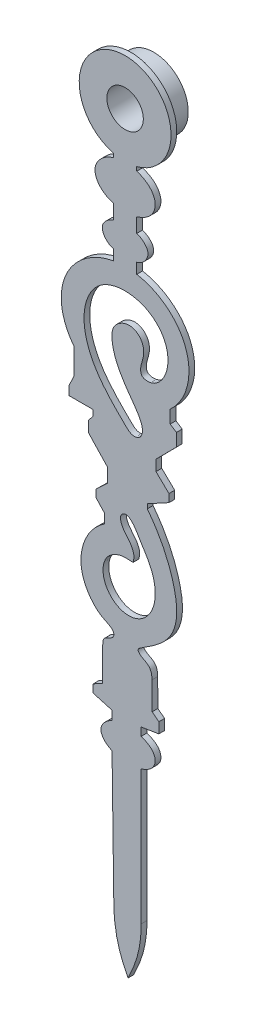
ISO-10303-21;
HEADER;
FILE_DESCRIPTION(('STEP AP214'),'2;1');
FILE_NAME('part.step','',(''),(''),'','','');
FILE_SCHEMA(('AUTOMOTIVE_DESIGN { 1 0 10303 214 1 1 1 1 }'));
ENDSEC;
DATA;
#1=APPLICATION_CONTEXT('core data for automotive mechanical design processes');
#2=APPLICATION_PROTOCOL_DEFINITION('international standard','automotive_design',2000,#1);
#3=PRODUCT_CONTEXT('',#1,'mechanical');
#4=PRODUCT('Part','Part','',(#3));
#5=PRODUCT_RELATED_PRODUCT_CATEGORY('part','',(#4));
#6=PRODUCT_DEFINITION_FORMATION('','',#4);
#7=PRODUCT_DEFINITION_CONTEXT('part definition',#1,'design');
#8=PRODUCT_DEFINITION('design','',#6,#7);
#9=PRODUCT_DEFINITION_SHAPE('','',#8);
#10=(LENGTH_UNIT() NAMED_UNIT(*) SI_UNIT(.MILLI.,.METRE.));
#11=(NAMED_UNIT(*) PLANE_ANGLE_UNIT() SI_UNIT($,.RADIAN.));
#12=(NAMED_UNIT(*) SI_UNIT($,.STERADIAN.) SOLID_ANGLE_UNIT());
#13=UNCERTAINTY_MEASURE_WITH_UNIT(LENGTH_MEASURE(1.E-05),#10,'distance_accuracy_value','');
#14=(GEOMETRIC_REPRESENTATION_CONTEXT(3) GLOBAL_UNCERTAINTY_ASSIGNED_CONTEXT((#13)) GLOBAL_UNIT_ASSIGNED_CONTEXT((#10,
#11,#12)) REPRESENTATION_CONTEXT('',''));
#15=CARTESIAN_POINT('',(0.,0.,0.));
#16=DIRECTION('',(0.,0.,1.));
#17=DIRECTION('',(1.,0.,0.));
#18=AXIS2_PLACEMENT_3D('',#15,#16,#17);
#19=CARTESIAN_POINT('',(0.,61.4629,0.));
#20=DIRECTION('',(0.,0.,1.));
#21=DIRECTION('',(1.,0.,0.));
#22=AXIS2_PLACEMENT_3D('',#19,#20,#21);
#23=PLANE('',#22);
#24=CARTESIAN_POINT('',(0.0883000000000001,-6.2807,0.));
#25=CARTESIAN_POINT('',(-1.12728112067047,-6.24782380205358,0.));
#26=CARTESIAN_POINT('',(-3.16278948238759,-7.18218736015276,0.));
#27=CARTESIAN_POINT('',(-4.05211717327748,-9.89521164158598,0.));
#28=CARTESIAN_POINT('',(-3.48291813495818,-12.4887073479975,0.));
#29=CARTESIAN_POINT('',(-1.39292445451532,-14.5650153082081,0.));
#30=CARTESIAN_POINT('',(1.42117630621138,-14.937624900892,0.));
#31=CARTESIAN_POINT('',(3.80349631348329,-13.6045743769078,0.));
#32=CARTESIAN_POINT('',(5.25252866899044,-11.0124401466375,0.));
#33=CARTESIAN_POINT('',(5.37759578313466,-7.49273626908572,0.));
#34=CARTESIAN_POINT('',(4.04997822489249,-4.52226236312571,0.));
#35=CARTESIAN_POINT('',(2.43860351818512,-2.21322981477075,0.));
#36=CARTESIAN_POINT('',(1.60246744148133,-0.528878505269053,0.));
#37=CARTESIAN_POINT('',(0.223070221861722,0.535072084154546,0.));
#38=CARTESIAN_POINT('',(-0.873983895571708,-0.148253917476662,0.));
#39=CARTESIAN_POINT('',(-0.789910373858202,-1.40185560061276,0.));
#40=CARTESIAN_POINT('',(-0.0368709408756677,-2.56693414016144,0.));
#41=CARTESIAN_POINT('',(1.03606442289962,-3.70307738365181,0.));
#42=CARTESIAN_POINT('',(1.66691595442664,-5.11077213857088,0.));
#43=CARTESIAN_POINT('',(1.46830119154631,-5.9862735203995,0.));
#44=CARTESIAN_POINT('',(1.3935,-6.316,0.));
#45=B_SPLINE_CURVE_WITH_KNOTS('',3,(#24,#25,#26,#27,#28,#29,#30,#31,#32,#33,#34,#35,#36,#37,#38,
#39,#40,#41,#42,#43,#44),.UNSPECIFIED.,.F.,.F.,(4,1,1,1,1,1,1,1,1,1,1,1,1,1,1,1,1,1,4),(0.,
0.0905924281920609,0.140607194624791,0.205939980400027,0.281326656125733,0.34843062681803,
0.404863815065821,0.477382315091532,0.562775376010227,0.661255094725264,0.717940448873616,
0.773624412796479,0.808585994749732,0.828548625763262,0.856146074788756,0.891523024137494,
0.933283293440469,0.974873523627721,1.),.UNSPECIFIED.);
#46=CARTESIAN_POINT('',(0.0882999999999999,-6.2807,0.));
#47=VERTEX_POINT('',#46);
#48=CARTESIAN_POINT('',(1.3935,-6.316,0.));
#49=VERTEX_POINT('',#48);
#50=EDGE_CURVE('E52',#47,#49,#45,.T.);
#51=ORIENTED_EDGE('',*,*,#50,.T.);
#52=DIRECTION('',(-0.999634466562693,0.027035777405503,0.));
#53=VECTOR('',#52,1.);
#54=CARTESIAN_POINT('',(0.0883,-6.2807,0.));
#55=LINE('',#54,#53);
#56=EDGE_CURVE('E388',#49,#47,#55,.T.);
#57=ORIENTED_EDGE('',*,*,#56,.T.);
#58=EDGE_LOOP('',(#51,#57));
#59=FACE_BOUND('',#58,.T.);
#60=CARTESIAN_POINT('',(0.,61.4629,0.));
#61=DIRECTION('',(0.,0.,1.));
#62=DIRECTION('',(1.,0.,0.));
#63=AXIS2_PLACEMENT_3D('',#60,#61,#62);
#64=CIRCLE('',#63,8.);
#65=CARTESIAN_POINT('',(2.0285,53.7243479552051,0.));
#66=VERTEX_POINT('',#65);
#67=CARTESIAN_POINT('',(-2.0284,53.7243217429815,0.));
#68=VERTEX_POINT('',#67);
#69=EDGE_CURVE('E439',#66,#68,#64,.T.);
#70=ORIENTED_EDGE('',*,*,#69,.F.);
#71=DIRECTION('',(0.,1.,0.));
#72=VECTOR('',#71,1.);
#73=CARTESIAN_POINT('',(2.0285,53.0213,0.));
#74=LINE('',#73,#72);
#75=CARTESIAN_POINT('',(2.0285,53.0213,0.));
#76=VERTEX_POINT('',#75);
#77=EDGE_CURVE('E601',#76,#66,#74,.T.);
#78=ORIENTED_EDGE('',*,*,#77,.F.);
#79=CARTESIAN_POINT('',(2.0285,46.1421,0.));
#80=CARTESIAN_POINT('',(2.96730025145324,46.4593099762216,0.));
#81=CARTESIAN_POINT('',(4.41396725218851,47.1598865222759,0.));
#82=CARTESIAN_POINT('',(5.2555599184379,48.9125783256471,0.));
#83=CARTESIAN_POINT('',(5.26476779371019,50.2426957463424,0.));
#84=CARTESIAN_POINT('',(4.37895814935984,51.9677765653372,0.));
#85=CARTESIAN_POINT('',(3.00242933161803,52.726020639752,0.));
#86=CARTESIAN_POINT('',(2.0285,53.0213,0.));
#87=B_SPLINE_CURVE_WITH_KNOTS('',3,(#79,#80,#81,#82,#83,#84,#85,#86),.UNSPECIFIED.,.F.,.F.,(4,1,
1,1,1,4),(0.,0.306712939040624,0.438868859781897,0.561962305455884,0.690951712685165,1.),.UNSPECIFIED.);
#88=CARTESIAN_POINT('',(2.0285,46.1421,0.));
#89=VERTEX_POINT('',#88);
#90=EDGE_CURVE('E597',#89,#76,#87,.T.);
#91=ORIENTED_EDGE('',*,*,#90,.F.);
#92=DIRECTION('',(0.,1.,0.));
#93=VECTOR('',#92,1.);
#94=CARTESIAN_POINT('',(2.0285,43.6374,0.));
#95=LINE('',#94,#93);
#96=CARTESIAN_POINT('',(2.0285,43.6374,0.));
#97=VERTEX_POINT('',#96);
#98=EDGE_CURVE('E592',#97,#89,#95,.T.);
#99=ORIENTED_EDGE('',*,*,#98,.F.);
#100=CARTESIAN_POINT('',(2.0285,39.2982,0.));
#101=CARTESIAN_POINT('',(3.01922764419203,39.4637689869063,0.));
#102=CARTESIAN_POINT('',(5.01853928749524,41.684981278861,0.));
#103=CARTESIAN_POINT('',(2.8643597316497,43.3796693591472,0.));
#104=CARTESIAN_POINT('',(2.0285,43.6374,0.));
#105=B_SPLINE_CURVE_WITH_KNOTS('',3,(#100,#101,#102,#103,#104),.UNSPECIFIED.,.F.,.F.,(4,1,4),
(0.,0.536892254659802,1.),.UNSPECIFIED.);
#106=CARTESIAN_POINT('',(2.0285,39.2982,0.));
#107=VERTEX_POINT('',#106);
#108=EDGE_CURVE('E588',#107,#97,#105,.T.);
#109=ORIENTED_EDGE('',*,*,#108,.F.);
#110=DIRECTION('',(0.,1.,0.));
#111=VECTOR('',#110,1.);
#112=CARTESIAN_POINT('',(2.0285,37.4638,0.));
#113=LINE('',#112,#111);
#114=CARTESIAN_POINT('',(2.0285,37.4638,0.));
#115=VERTEX_POINT('',#114);
#116=EDGE_CURVE('E583',#115,#107,#113,.T.);
#117=ORIENTED_EDGE('',*,*,#116,.F.);
#118=CARTESIAN_POINT('',(7.8494,20.0365,0.));
#119=CARTESIAN_POINT('',(9.90969205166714,21.8775586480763,0.));
#120=CARTESIAN_POINT('',(11.8625778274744,26.2434885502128,0.));
#121=CARTESIAN_POINT('',(9.80386739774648,33.9222872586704,0.));
#122=CARTESIAN_POINT('',(5.26831542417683,36.9360366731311,0.));
#123=CARTESIAN_POINT('',(2.0285,37.4638,0.));
#124=B_SPLINE_CURVE_WITH_KNOTS('',3,(#118,#119,#120,#121,#122,#123),.UNSPECIFIED.,.F.,.F.,(4,1,
1,4),(0.,0.362536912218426,0.568622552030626,1.),.UNSPECIFIED.);
#125=CARTESIAN_POINT('',(7.8494,20.0365,0.));
#126=VERTEX_POINT('',#125);
#127=EDGE_CURVE('E579',#126,#115,#124,.T.);
#128=ORIENTED_EDGE('',*,*,#127,.F.);
#129=DIRECTION('',(0.,1.,0.));
#130=VECTOR('',#129,1.);
#131=CARTESIAN_POINT('',(7.8494,17.7788,0.));
#132=LINE('',#131,#130);
#133=CARTESIAN_POINT('',(7.8494,17.7788,0.));
#134=VERTEX_POINT('',#133);
#135=EDGE_CURVE('E577',#134,#126,#132,.T.);
#136=ORIENTED_EDGE('',*,*,#135,.F.);
#137=DIRECTION('',(-0.840278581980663,0.542154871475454,0.));
#138=VECTOR('',#137,1.);
#139=CARTESIAN_POINT('',(8.943,17.0732,0.));
#140=LINE('',#139,#138);
#141=CARTESIAN_POINT('',(8.943,17.0732,0.));
#142=VERTEX_POINT('',#141);
#143=EDGE_CURVE('E575',#142,#134,#140,.T.);
#144=ORIENTED_EDGE('',*,*,#143,.F.);
#145=DIRECTION('',(0.,1.,0.));
#146=VECTOR('',#145,1.);
#147=CARTESIAN_POINT('',(8.943,14.8507,0.));
#148=LINE('',#147,#146);
#149=CARTESIAN_POINT('',(8.943,14.8507,0.));
#150=VERTEX_POINT('',#149);
#151=EDGE_CURVE('E573',#150,#142,#148,.T.);
#152=ORIENTED_EDGE('',*,*,#151,.F.);
#153=DIRECTION('',(0.703622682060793,0.710573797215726,0.));
#154=VECTOR('',#153,1.);
#155=CARTESIAN_POINT('',(5.3799,11.2524,0.));
#156=LINE('',#155,#154);
#157=CARTESIAN_POINT('',(5.3799,11.2524,0.));
#158=VERTEX_POINT('',#157);
#159=EDGE_CURVE('E571',#158,#150,#156,.T.);
#160=ORIENTED_EDGE('',*,*,#159,.F.);
#161=DIRECTION('',(0.,1.,0.));
#162=VECTOR('',#161,1.);
#163=CARTESIAN_POINT('',(5.3799,9.3827,0.));
#164=LINE('',#163,#162);
#165=CARTESIAN_POINT('',(5.3799,9.3827,0.));
#166=VERTEX_POINT('',#165);
#167=EDGE_CURVE('E569',#166,#158,#164,.T.);
#168=ORIENTED_EDGE('',*,*,#167,.F.);
#169=DIRECTION('',(-0.718231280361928,0.695804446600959,0.));
#170=VECTOR('',#169,1.);
#171=CARTESIAN_POINT('',(7.6377,7.1954,0.));
#172=LINE('',#171,#170);
#173=CARTESIAN_POINT('',(7.6377,7.1954,0.));
#174=VERTEX_POINT('',#173);
#175=EDGE_CURVE('E567',#174,#166,#172,.T.);
#176=ORIENTED_EDGE('',*,*,#175,.F.);
#177=DIRECTION('',(0.,1.,0.));
#178=VECTOR('',#177,1.);
#179=CARTESIAN_POINT('',(7.6377,5.8196,0.));
#180=LINE('',#179,#178);
#181=CARTESIAN_POINT('',(7.6377,5.8196,0.));
#182=VERTEX_POINT('',#181);
#183=EDGE_CURVE('E565',#182,#174,#180,.T.);
#184=ORIENTED_EDGE('',*,*,#183,.F.);
#185=DIRECTION('',(0.879148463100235,0.476547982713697,0.));
#186=VECTOR('',#185,1.);
#187=CARTESIAN_POINT('',(3.863,3.7735,0.));
#188=LINE('',#187,#186);
#189=CARTESIAN_POINT('',(3.863,3.7735,0.));
#190=VERTEX_POINT('',#189);
#191=EDGE_CURVE('E563',#190,#182,#188,.T.);
#192=ORIENTED_EDGE('',*,*,#191,.F.);
#193=DIRECTION('',(0.,1.,0.));
#194=VECTOR('',#193,1.);
#195=CARTESIAN_POINT('',(3.863,2.9974,0.));
#196=LINE('',#195,#194);
#197=CARTESIAN_POINT('',(3.863,2.9974,0.));
#198=VERTEX_POINT('',#197);
#199=EDGE_CURVE('E558',#198,#190,#196,.T.);
#200=ORIENTED_EDGE('',*,*,#199,.F.);
#201=CARTESIAN_POINT('',(4.6744,-22.4026,0.));
#202=CARTESIAN_POINT('',(4.66740550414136,-21.4519429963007,0.));
#203=CARTESIAN_POINT('',(4.39418061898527,-20.6368153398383,0.));
#204=CARTESIAN_POINT('',(3.18861674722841,-19.9811054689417,0.));
#205=CARTESIAN_POINT('',(2.54519028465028,-19.6492791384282,0.));
#206=CARTESIAN_POINT('',(2.08825483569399,-18.9490234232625,0.));
#207=CARTESIAN_POINT('',(3.70072887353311,-17.9514049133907,0.));
#208=CARTESIAN_POINT('',(5.3779590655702,-16.8507012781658,0.));
#209=CARTESIAN_POINT('',(8.03104186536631,-14.53686331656,0.));
#210=CARTESIAN_POINT('',(9.28089739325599,-10.7846743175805,0.));
#211=CARTESIAN_POINT('',(8.37743197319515,-4.43761861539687,0.));
#212=CARTESIAN_POINT('',(6.07586211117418,0.182361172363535,0.));
#213=CARTESIAN_POINT('',(3.863,2.9974,0.));
#214=B_SPLINE_CURVE_WITH_KNOTS('',3,(#201,#202,#203,#204,#205,#206,#207,#208,#209,#210,#211,
#212,#213),.UNSPECIFIED.,.F.,.F.,(4,1,1,1,1,1,1,1,1,1,4),(0.,0.0667439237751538,
0.0997417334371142,0.128204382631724,0.140208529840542,0.173229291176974,0.26894797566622,
0.375302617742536,0.501812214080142,0.644629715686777,1.),.UNSPECIFIED.);
#215=CARTESIAN_POINT('',(4.6744,-22.4026,0.));
#216=VERTEX_POINT('',#215);
#217=EDGE_CURVE('E554',#216,#198,#214,.T.);
#218=ORIENTED_EDGE('',*,*,#217,.F.);
#219=DIRECTION('',(-0.00735733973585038,0.999972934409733,0.));
#220=VECTOR('',#219,1.);
#221=CARTESIAN_POINT('',(4.7097,-27.2004,0.));
#222=LINE('',#221,#220);
#223=CARTESIAN_POINT('',(4.7097,-27.2004,0.));
#224=VERTEX_POINT('',#223);
#225=EDGE_CURVE('E552',#224,#216,#222,.T.);
#226=ORIENTED_EDGE('',*,*,#225,.F.);
#227=DIRECTION('',(-0.785481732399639,0.618884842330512,0.));
#228=VECTOR('',#227,1.);
#229=CARTESIAN_POINT('',(5.8738,-28.1176,0.));
#230=LINE('',#229,#228);
#231=CARTESIAN_POINT('',(5.8738,-28.1176,0.));
#232=VERTEX_POINT('',#231);
#233=EDGE_CURVE('E550',#232,#224,#230,.T.);
#234=ORIENTED_EDGE('',*,*,#233,.F.);
#235=DIRECTION('',(0.,1.,0.));
#236=VECTOR('',#235,1.);
#237=CARTESIAN_POINT('',(5.8738,-29.9521,0.));
#238=LINE('',#237,#236);
#239=CARTESIAN_POINT('',(5.8738,-29.9521,0.));
#240=VERTEX_POINT('',#239);
#241=EDGE_CURVE('E548',#240,#232,#238,.T.);
#242=ORIENTED_EDGE('',*,*,#241,.F.);
#243=DIRECTION('',(0.987297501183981,0.15888248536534,0.));
#244=VECTOR('',#243,1.);
#245=CARTESIAN_POINT('',(2.8047,-30.446,0.));
#246=LINE('',#245,#244);
#247=CARTESIAN_POINT('',(2.8047,-30.446,0.));
#248=VERTEX_POINT('',#247);
#249=EDGE_CURVE('E546',#248,#240,#246,.T.);
#250=ORIENTED_EDGE('',*,*,#249,.F.);
#251=DIRECTION('',(0.,1.,0.));
#252=VECTOR('',#251,1.);
#253=CARTESIAN_POINT('',(2.8047,-31.8571,0.));
#254=LINE('',#253,#252);
#255=CARTESIAN_POINT('',(2.8047,-31.8571,0.));
#256=VERTEX_POINT('',#255);
#257=EDGE_CURVE('E541',#256,#248,#254,.T.);
#258=ORIENTED_EDGE('',*,*,#257,.F.);
#259=CARTESIAN_POINT('',(2.8047,-36.796,0.));
#260=CARTESIAN_POINT('',(3.57887999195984,-36.5034279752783,0.));
#261=CARTESIAN_POINT('',(4.85994535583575,-35.9110220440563,0.));
#262=CARTESIAN_POINT('',(5.3446684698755,-34.3265036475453,0.));
#263=CARTESIAN_POINT('',(4.85997298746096,-32.7419756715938,0.));
#264=CARTESIAN_POINT('',(3.57879481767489,-32.1497294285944,0.));
#265=CARTESIAN_POINT('',(2.8047,-31.8571,0.));
#266=B_SPLINE_CURVE_WITH_KNOTS('',3,(#259,#260,#261,#262,#263,#264,#265),.UNSPECIFIED.,.F.,.F.,
(4,1,1,1,4),(0.,0.360277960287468,0.500004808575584,0.639731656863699,1.),.UNSPECIFIED.);
#267=CARTESIAN_POINT('',(2.8047,-36.796,0.));
#268=VERTEX_POINT('',#267);
#269=EDGE_CURVE('E537',#268,#256,#266,.T.);
#270=ORIENTED_EDGE('',*,*,#269,.F.);
#271=DIRECTION('',(0.,1.,0.));
#272=VECTOR('',#271,1.);
#273=CARTESIAN_POINT('',(2.8047,-60.1499,0.));
#274=LINE('',#273,#272);
#275=CARTESIAN_POINT('',(2.8047,-60.1499,0.));
#276=VERTEX_POINT('',#275);
#277=EDGE_CURVE('E532',#276,#268,#274,.T.);
#278=ORIENTED_EDGE('',*,*,#277,.F.);
#279=CARTESIAN_POINT('',(0.5116,-69.4632,0.));
#280=CARTESIAN_POINT('',(1.22202434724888,-68.0196502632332,0.));
#281=CARTESIAN_POINT('',(2.1588100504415,-65.7659263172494,0.));
#282=CARTESIAN_POINT('',(2.71019651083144,-62.5774090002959,0.));
#283=CARTESIAN_POINT('',(2.8047,-60.9608584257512,0.));
#284=CARTESIAN_POINT('',(2.8047,-60.1499,0.));
#285=B_SPLINE_CURVE_WITH_KNOTS('',3,(#279,#280,#281,#282,#283,#284),.UNSPECIFIED.,.F.,.F.,(4,1,
1,4),(0.,0.500130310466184,0.748154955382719,1.),.UNSPECIFIED.);
#286=CARTESIAN_POINT('',(0.5116,-69.4632,0.));
#287=VERTEX_POINT('',#286);
#288=EDGE_CURVE('E525',#287,#276,#285,.T.);
#289=ORIENTED_EDGE('',*,*,#288,.F.);
#290=CARTESIAN_POINT('',(-1.9578,-60.1499,0.));
#291=CARTESIAN_POINT('',(-1.94685333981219,-60.9623869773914,0.));
#292=CARTESIAN_POINT('',(-1.77819176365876,-62.5778055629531,0.));
#293=CARTESIAN_POINT('',(-1.19733077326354,-65.7699360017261,0.));
#294=CARTESIAN_POINT('',(-0.243492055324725,-68.0316572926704,0.));
#295=CARTESIAN_POINT('',(0.5116,-69.4632,0.));
#296=B_SPLINE_CURVE_WITH_KNOTS('',3,(#290,#291,#292,#293,#294,#295),.UNSPECIFIED.,.F.,.F.,(4,1,
1,4),(0.,0.251367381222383,0.499072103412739,1.),.UNSPECIFIED.);
#297=CARTESIAN_POINT('',(-1.9578,-60.1499,0.));
#298=VERTEX_POINT('',#297);
#299=EDGE_CURVE('E521',#298,#287,#296,.T.);
#300=ORIENTED_EDGE('',*,*,#299,.F.);
#301=DIRECTION('',(0.0134718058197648,-0.999909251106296,0.));
#302=VECTOR('',#301,1.);
#303=CARTESIAN_POINT('',(-2.2753,-36.5843,0.));
#304=LINE('',#303,#302);
#305=CARTESIAN_POINT('',(-2.2753,-36.5843,0.));
#306=VERTEX_POINT('',#305);
#307=EDGE_CURVE('E516',#306,#298,#304,.T.);
#308=ORIENTED_EDGE('',*,*,#307,.F.);
#309=CARTESIAN_POINT('',(-2.2753,-32.0335,0.));
#310=CARTESIAN_POINT('',(-3.05417282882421,-32.3288042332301,0.));
#311=CARTESIAN_POINT('',(-4.62799519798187,-33.6395811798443,0.));
#312=CARTESIAN_POINT('',(-3.79973055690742,-35.7227153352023,0.));
#313=CARTESIAN_POINT('',(-2.87218182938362,-36.2879533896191,0.));
#314=CARTESIAN_POINT('',(-2.2753,-36.5843,0.));
#315=B_SPLINE_CURVE_WITH_KNOTS('',3,(#309,#310,#311,#312,#313,#314),.UNSPECIFIED.,.F.,.F.,(4,1,
1,4),(0.,0.500674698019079,0.674613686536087,1.),.UNSPECIFIED.);
#316=CARTESIAN_POINT('',(-2.2753,-32.0335,0.));
#317=VERTEX_POINT('',#316);
#318=EDGE_CURVE('E512',#317,#306,#315,.T.);
#319=ORIENTED_EDGE('',*,*,#318,.F.);
#320=DIRECTION('',(0.,-1.,0.));
#321=VECTOR('',#320,1.);
#322=CARTESIAN_POINT('',(-2.2753,-30.446,0.));
#323=LINE('',#322,#321);
#324=CARTESIAN_POINT('',(-2.2753,-30.446,0.));
#325=VERTEX_POINT('',#324);
#326=EDGE_CURVE('E510',#325,#317,#323,.T.);
#327=ORIENTED_EDGE('',*,*,#326,.F.);
#328=DIRECTION('',(0.963066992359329,-0.269261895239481,0.));
#329=VECTOR('',#328,1.);
#330=CARTESIAN_POINT('',(-5.5562,-29.5287,0.));
#331=LINE('',#330,#329);
#332=CARTESIAN_POINT('',(-5.5562,-29.5287,0.));
#333=VERTEX_POINT('',#332);
#334=EDGE_CURVE('E508',#333,#325,#331,.T.);
#335=ORIENTED_EDGE('',*,*,#334,.F.);
#336=DIRECTION('',(0.,-1.,0.));
#337=VECTOR('',#336,1.);
#338=CARTESIAN_POINT('',(-5.5562,-28.1176,0.));
#339=LINE('',#338,#337);
#340=CARTESIAN_POINT('',(-5.5562,-28.1176,0.));
#341=VERTEX_POINT('',#340);
#342=EDGE_CURVE('E506',#341,#333,#339,.T.);
#343=ORIENTED_EDGE('',*,*,#342,.F.);
#344=DIRECTION('',(-0.875044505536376,-0.484042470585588,0.));
#345=VECTOR('',#344,1.);
#346=CARTESIAN_POINT('',(-3.8981,-27.2004,0.));
#347=LINE('',#346,#345);
#348=CARTESIAN_POINT('',(-3.8981,-27.2004,0.));
#349=VERTEX_POINT('',#348);
#350=EDGE_CURVE('E504',#349,#341,#347,.T.);
#351=ORIENTED_EDGE('',*,*,#350,.F.);
#352=DIRECTION('',(0.,-1.,0.));
#353=VECTOR('',#352,1.);
#354=CARTESIAN_POINT('',(-3.8981,-21.6618,0.));
#355=LINE('',#354,#353);
#356=CARTESIAN_POINT('',(-3.8981,-21.6618,0.));
#357=VERTEX_POINT('',#356);
#358=EDGE_CURVE('E499',#357,#349,#355,.T.);
#359=ORIENTED_EDGE('',*,*,#358,.F.);
#360=CARTESIAN_POINT('',(-3.5806,-2.9999,0.));
#361=CARTESIAN_POINT('',(-5.62791121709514,-4.34140282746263,0.));
#362=CARTESIAN_POINT('',(-7.62493972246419,-7.36261660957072,0.));
#363=CARTESIAN_POINT('',(-7.79168825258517,-11.7707192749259,0.));
#364=CARTESIAN_POINT('',(-6.66596218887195,-14.7558389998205,0.));
#365=CARTESIAN_POINT('',(-4.76839471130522,-17.0030844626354,0.));
#366=CARTESIAN_POINT('',(-2.8207657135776,-17.7587245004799,0.));
#367=CARTESIAN_POINT('',(-1.92422855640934,-18.4790505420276,0.));
#368=CARTESIAN_POINT('',(-1.98190262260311,-19.4001824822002,0.));
#369=CARTESIAN_POINT('',(-2.81026000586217,-19.811177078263,0.));
#370=CARTESIAN_POINT('',(-3.91378082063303,-20.247167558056,0.));
#371=CARTESIAN_POINT('',(-3.8981,-21.2355634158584,0.));
#372=CARTESIAN_POINT('',(-3.8981,-21.6618,0.));
#373=B_SPLINE_CURVE_WITH_KNOTS('',3,(#360,#361,#362,#363,#364,#365,#366,#367,#368,#369,#370,
#371,#372),.UNSPECIFIED.,.F.,.F.,(4,1,1,1,1,1,1,1,1,1,4),(0.,0.312275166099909,
0.435687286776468,0.557102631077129,0.72093697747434,0.791808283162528,0.832793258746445,
0.855688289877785,0.898037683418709,0.941145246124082,1.),.UNSPECIFIED.);
#374=CARTESIAN_POINT('',(-3.5806,-2.9999,0.));
#375=VERTEX_POINT('',#374);
#376=EDGE_CURVE('E495',#375,#357,#373,.T.);
#377=ORIENTED_EDGE('',*,*,#376,.F.);
#378=DIRECTION('',(0.,-1.,0.));
#379=VECTOR('',#378,1.);
#380=CARTESIAN_POINT('',(-3.5806,-1.3771,0.));
#381=LINE('',#380,#379);
#382=CARTESIAN_POINT('',(-3.5806,-1.3771,0.));
#383=VERTEX_POINT('',#382);
#384=EDGE_CURVE('E493',#383,#375,#381,.T.);
#385=ORIENTED_EDGE('',*,*,#384,.F.);
#386=DIRECTION('',(0.682326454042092,-0.7310476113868,0.));
#387=VECTOR('',#386,1.);
#388=CARTESIAN_POINT('',(-5.0623,0.2104,0.));
#389=LINE('',#388,#387);
#390=CARTESIAN_POINT('',(-5.0623,0.2104,0.));
#391=VERTEX_POINT('',#390);
#392=EDGE_CURVE('E491',#391,#383,#389,.T.);
#393=ORIENTED_EDGE('',*,*,#392,.F.);
#394=DIRECTION('',(0.,-1.,0.));
#395=VECTOR('',#394,1.);
#396=CARTESIAN_POINT('',(-5.0623,1.5157,0.));
#397=LINE('',#396,#395);
#398=CARTESIAN_POINT('',(-5.0623,1.5157,0.));
#399=VERTEX_POINT('',#398);
#400=EDGE_CURVE('E489',#399,#391,#397,.T.);
#401=ORIENTED_EDGE('',*,*,#400,.F.);
#402=DIRECTION('',(-0.725946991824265,-0.687750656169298,0.));
#403=VECTOR('',#402,1.);
#404=CARTESIAN_POINT('',(-3.0515,3.4207,0.));
#405=LINE('',#404,#403);
#406=CARTESIAN_POINT('',(-3.0515,3.4207,0.));
#407=VERTEX_POINT('',#406);
#408=EDGE_CURVE('E487',#407,#399,#405,.T.);
#409=ORIENTED_EDGE('',*,*,#408,.F.);
#410=DIRECTION('',(0.,-1.,0.));
#411=VECTOR('',#410,1.);
#412=CARTESIAN_POINT('',(-3.0515,5.8196,0.));
#413=LINE('',#412,#411);
#414=CARTESIAN_POINT('',(-3.0515,5.8196,0.));
#415=VERTEX_POINT('',#414);
#416=EDGE_CURVE('E485',#415,#407,#413,.T.);
#417=ORIENTED_EDGE('',*,*,#416,.F.);
#418=DIRECTION('',(0.685125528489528,-0.728425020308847,0.));
#419=VECTOR('',#418,1.);
#420=CARTESIAN_POINT('',(-6.4028,9.3827,0.));
#421=LINE('',#420,#419);
#422=CARTESIAN_POINT('',(-6.4028,9.3827,0.));
#423=VERTEX_POINT('',#422);
#424=EDGE_CURVE('E483',#423,#415,#421,.T.);
#425=ORIENTED_EDGE('',*,*,#424,.F.);
#426=DIRECTION('',(0.,-1.,0.));
#427=VECTOR('',#426,1.);
#428=CARTESIAN_POINT('',(-6.4028,11.2524,0.));
#429=LINE('',#428,#427);
#430=CARTESIAN_POINT('',(-6.4028,11.2524,0.));
#431=VERTEX_POINT('',#430);
#432=EDGE_CURVE('E481',#431,#423,#429,.T.);
#433=ORIENTED_EDGE('',*,*,#432,.F.);
#434=DIRECTION('',(-0.650791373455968,-0.759256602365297,0.));
#435=VECTOR('',#434,1.);
#436=CARTESIAN_POINT('',(-5.5562,12.2401,0.));
#437=LINE('',#436,#435);
#438=CARTESIAN_POINT('',(-5.5562,12.2401,0.));
#439=VERTEX_POINT('',#438);
#440=EDGE_CURVE('E479',#439,#431,#437,.T.);
#441=ORIENTED_EDGE('',*,*,#440,.F.);
#442=DIRECTION('',(0.,-1.,0.));
#443=VECTOR('',#442,1.);
#444=CARTESIAN_POINT('',(-5.5562,13.2632,0.));
#445=LINE('',#444,#443);
#446=CARTESIAN_POINT('',(-5.5562,13.2632,0.));
#447=VERTEX_POINT('',#446);
#448=EDGE_CURVE('E477',#447,#439,#445,.T.);
#449=ORIENTED_EDGE('',*,*,#448,.F.);
#450=DIRECTION('',(1.,0.,0.));
#451=VECTOR('',#450,1.);
#452=CARTESIAN_POINT('',(-9.7542,13.2632,0.));
#453=LINE('',#452,#451);
#454=CARTESIAN_POINT('',(-9.7542,13.2632,0.));
#455=VERTEX_POINT('',#454);
#456=EDGE_CURVE('E475',#455,#447,#453,.T.);
#457=ORIENTED_EDGE('',*,*,#456,.F.);
#458=DIRECTION('',(0.,-1.,0.));
#459=VECTOR('',#458,1.);
#460=CARTESIAN_POINT('',(-9.7542,14.8507,0.));
#461=LINE('',#460,#459);
#462=CARTESIAN_POINT('',(-9.7542,14.8507,0.));
#463=VERTEX_POINT('',#462);
#464=EDGE_CURVE('E473',#463,#455,#461,.T.);
#465=ORIENTED_EDGE('',*,*,#464,.F.);
#466=DIRECTION('',(-0.433285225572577,-0.901256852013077,0.));
#467=VECTOR('',#466,1.);
#468=CARTESIAN_POINT('',(-8.8723,16.6851,0.));
#469=LINE('',#468,#467);
#470=CARTESIAN_POINT('',(-8.8723,16.6851,0.));
#471=VERTEX_POINT('',#470);
#472=EDGE_CURVE('E471',#471,#463,#469,.T.);
#473=ORIENTED_EDGE('',*,*,#472,.F.);
#474=DIRECTION('',(0.,-1.,0.));
#475=VECTOR('',#474,1.);
#476=CARTESIAN_POINT('',(-8.8723,21.1301,0.));
#477=LINE('',#476,#475);
#478=CARTESIAN_POINT('',(-8.8723,21.1301,0.));
#479=VERTEX_POINT('',#478);
#480=EDGE_CURVE('E466',#479,#471,#477,.T.);
#481=ORIENTED_EDGE('',*,*,#480,.F.);
#482=CARTESIAN_POINT('',(-2.0284,37.4638,0.));
#483=CARTESIAN_POINT('',(-5.2284731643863,36.9291620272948,0.));
#484=CARTESIAN_POINT('',(-9.67471697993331,33.9945406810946,0.));
#485=CARTESIAN_POINT('',(-11.7718715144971,26.8732249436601,0.));
#486=CARTESIAN_POINT('',(-10.333689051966,22.9314678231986,0.));
#487=CARTESIAN_POINT('',(-8.8723,21.1301,0.));
#488=B_SPLINE_CURVE_WITH_KNOTS('',3,(#482,#483,#484,#485,#486,#487),.UNSPECIFIED.,.F.,.F.,(4,1,
1,4),(0.,0.455417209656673,0.672007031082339,1.),.UNSPECIFIED.);
#489=CARTESIAN_POINT('',(-2.0284,37.4638,0.));
#490=VERTEX_POINT('',#489);
#491=EDGE_CURVE('E462',#490,#479,#488,.T.);
#492=ORIENTED_EDGE('',*,*,#491,.F.);
#493=DIRECTION('',(0.,-1.,0.));
#494=VECTOR('',#493,1.);
#495=CARTESIAN_POINT('',(-2.0284,39.2982,0.));
#496=LINE('',#495,#494);
#497=CARTESIAN_POINT('',(-2.0284,39.2982,0.));
#498=VERTEX_POINT('',#497);
#499=EDGE_CURVE('E457',#498,#490,#496,.T.);
#500=ORIENTED_EDGE('',*,*,#499,.F.);
#501=CARTESIAN_POINT('',(-2.0284,43.6374,0.));
#502=CARTESIAN_POINT('',(-2.84613557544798,43.3452402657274,0.));
#503=CARTESIAN_POINT('',(-5.03173581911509,41.7002087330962,0.));
#504=CARTESIAN_POINT('',(-3.01467105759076,39.4586957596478,0.));
#505=CARTESIAN_POINT('',(-2.0284,39.2982,0.));
#506=B_SPLINE_CURVE_WITH_KNOTS('',3,(#501,#502,#503,#504,#505),.UNSPECIFIED.,.F.,.F.,(4,1,4),
(0.,0.46221235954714,1.),.UNSPECIFIED.);
#507=CARTESIAN_POINT('',(-2.0284,43.6374,0.));
#508=VERTEX_POINT('',#507);
#509=EDGE_CURVE('E453',#508,#498,#506,.T.);
#510=ORIENTED_EDGE('',*,*,#509,.F.);
#511=DIRECTION('',(0.,-1.,0.));
#512=VECTOR('',#511,1.);
#513=CARTESIAN_POINT('',(-2.0284,46.1421,0.));
#514=LINE('',#513,#512);
#515=CARTESIAN_POINT('',(-2.0284,46.1421,0.));
#516=VERTEX_POINT('',#515);
#517=EDGE_CURVE('E448',#516,#508,#514,.T.);
#518=ORIENTED_EDGE('',*,*,#517,.F.);
#519=CARTESIAN_POINT('',(-2.0284,53.0213,0.));
#520=CARTESIAN_POINT('',(-3.03001402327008,52.7594471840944,0.));
#521=CARTESIAN_POINT('',(-4.31706098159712,51.9334846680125,0.));
#522=CARTESIAN_POINT('',(-5.27153255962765,50.2549896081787,0.));
#523=CARTESIAN_POINT('',(-5.26208842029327,48.9004603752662,0.));
#524=CARTESIAN_POINT('',(-4.35260702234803,47.1937735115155,0.));
#525=CARTESIAN_POINT('',(-2.99392166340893,46.4260134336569,0.));
#526=CARTESIAN_POINT('',(-2.0284,46.1421,0.));
#527=B_SPLINE_CURVE_WITH_KNOTS('',3,(#519,#520,#521,#522,#523,#524,#525,#526),.UNSPECIFIED.,.F.,
.F.,(4,1,1,1,1,4),(0.,0.307108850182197,0.437945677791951,0.561301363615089,0.695274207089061,
1.),.UNSPECIFIED.);
#528=CARTESIAN_POINT('',(-2.0284,53.0213,0.));
#529=VERTEX_POINT('',#528);
#530=EDGE_CURVE('E444',#529,#516,#527,.T.);
#531=ORIENTED_EDGE('',*,*,#530,.F.);
#532=DIRECTION('',(0.,-1.,0.));
#533=VECTOR('',#532,1.);
#534=CARTESIAN_POINT('',(-2.0284,53.7243217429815,0.));
#535=LINE('',#534,#533);
#536=EDGE_CURVE('E442',#68,#529,#535,.T.);
#537=ORIENTED_EDGE('',*,*,#536,.F.);
#538=EDGE_LOOP('',(#70,#78,#91,#99,#109,#117,#128,#136,#144,#152,#160,#168,#176,#184,#192,#200,
#218,#226,#234,#242,#250,#258,#270,#278,#289,#300,#308,#319,#327,#335,#343,#351,#359,#377,#385,
#393,#401,#409,#417,#425,#433,#441,#449,#457,#465,#473,#481,#492,#500,#510,#518,#531,#537));
#539=FACE_BOUND('',#538,.T.);
#540=CARTESIAN_POINT('',(0.0883000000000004,13.6513,0.));
#541=CARTESIAN_POINT('',(0.418104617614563,13.3293859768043,0.));
#542=CARTESIAN_POINT('',(1.04835023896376,12.7159914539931,0.));
#543=CARTESIAN_POINT('',(2.48060072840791,12.8273726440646,0.));
#544=CARTESIAN_POINT('',(3.25559781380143,14.244120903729,0.));
#545=CARTESIAN_POINT('',(2.66237006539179,15.965703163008,0.));
#546=CARTESIAN_POINT('',(1.38011633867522,17.8776698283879,0.));
#547=CARTESIAN_POINT('',(-0.251712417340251,20.0180279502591,0.));
#548=CARTESIAN_POINT('',(-1.69433790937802,22.66337000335,0.));
#549=CARTESIAN_POINT('',(-2.37632920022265,25.191572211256,0.));
#550=CARTESIAN_POINT('',(-2.25639407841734,27.4642953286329,0.));
#551=CARTESIAN_POINT('',(-0.885310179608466,28.7748564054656,0.));
#552=CARTESIAN_POINT('',(0.858731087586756,29.3489823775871,0.));
#553=CARTESIAN_POINT('',(2.66489194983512,28.4782348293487,0.));
#554=CARTESIAN_POINT('',(3.42374651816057,26.6602392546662,0.));
#555=CARTESIAN_POINT('',(3.04796994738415,24.9574499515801,0.));
#556=CARTESIAN_POINT('',(2.61460267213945,23.7006597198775,0.));
#557=CARTESIAN_POINT('',(2.83183767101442,22.2864571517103,0.));
#558=CARTESIAN_POINT('',(4.52804760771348,22.172921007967,0.));
#559=CARTESIAN_POINT('',(5.93952749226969,23.032022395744,0.));
#560=CARTESIAN_POINT('',(7.51479015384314,25.270852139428,0.));
#561=CARTESIAN_POINT('',(7.73393226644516,29.5075907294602,0.));
#562=CARTESIAN_POINT('',(3.50136809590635,34.4105591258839,0.));
#563=CARTESIAN_POINT('',(-4.61074019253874,34.2373312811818,0.));
#564=CARTESIAN_POINT('',(-7.89615871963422,27.1490099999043,0.));
#565=CARTESIAN_POINT('',(-5.98186615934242,19.6528918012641,0.));
#566=CARTESIAN_POINT('',(-2.16784347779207,15.8534651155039,0.));
#567=CARTESIAN_POINT('',(0.0883000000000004,13.6513,0.));
#568=B_SPLINE_CURVE_WITH_KNOTS('',3,(#540,#541,#542,#543,#544,#545,#546,#547,#548,#549,#550,
#551,#552,#553,#554,#555,#556,#557,#558,#559,#560,#561,#562,#563,#564,#565,#566,#567),
.UNSPECIFIED.,.T.,.F.,(4,1,1,1,1,1,1,1,1,1,1,1,1,1,1,1,1,1,1,1,1,1,1,1,1,4),(0.,
0.0180376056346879,0.0342812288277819,0.0494203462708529,0.0760332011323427,0.102238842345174,
0.143443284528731,0.184194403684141,0.222748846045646,0.249119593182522,0.270259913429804,
0.295354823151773,0.318488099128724,0.343974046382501,0.368400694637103,0.386825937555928,
0.398564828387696,0.419409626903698,0.439785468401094,0.465601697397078,0.52645474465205,
0.594803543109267,0.706432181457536,0.783272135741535,0.876607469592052,1.),.UNSPECIFIED.);
#569=CARTESIAN_POINT('',(0.0883000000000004,13.6513,0.));
#570=VERTEX_POINT('',#569);
#571=EDGE_CURVE('E395',#570,#570,#568,.T.);
#572=ORIENTED_EDGE('',*,*,#571,.T.);
#573=EDGE_LOOP('',(#572));
#574=FACE_BOUND('',#573,.T.);
#575=CARTESIAN_POINT('',(0.,61.4629,0.));
#576=DIRECTION('',(0.,0.,1.));
#577=DIRECTION('',(1.,0.,0.));
#578=AXIS2_PLACEMENT_3D('',#575,#576,#577);
#579=CIRCLE('',#578,6.);
#580=CARTESIAN_POINT('',(6.,61.4629,0.));
#581=VERTEX_POINT('',#580);
#582=EDGE_CURVE('E11',#581,#581,#579,.F.);
#583=ORIENTED_EDGE('',*,*,#582,.F.);
#584=EDGE_LOOP('',(#583));
#585=FACE_BOUND('',#584,.T.);
#586=ADVANCED_FACE('F30',(#59,#539,#574,#585),#23,.F.);
#587=CARTESIAN_POINT('',(0.,61.4629,1.));
#588=DIRECTION('',(0.,0.,1.));
#589=DIRECTION('',(1.,0.,0.));
#590=AXIS2_PLACEMENT_3D('',#587,#588,#589);
#591=PLANE('',#590);
#592=CARTESIAN_POINT('',(0.0883000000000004,13.6513,1.));
#593=CARTESIAN_POINT('',(0.418104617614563,13.3293859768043,1.));
#594=CARTESIAN_POINT('',(1.04835023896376,12.7159914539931,1.));
#595=CARTESIAN_POINT('',(2.48060072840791,12.8273726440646,1.));
#596=CARTESIAN_POINT('',(3.25559781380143,14.244120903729,1.));
#597=CARTESIAN_POINT('',(2.66237006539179,15.965703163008,1.));
#598=CARTESIAN_POINT('',(1.38011633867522,17.8776698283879,1.));
#599=CARTESIAN_POINT('',(-0.251712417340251,20.0180279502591,1.));
#600=CARTESIAN_POINT('',(-1.69433790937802,22.66337000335,1.));
#601=CARTESIAN_POINT('',(-2.37632920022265,25.191572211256,1.));
#602=CARTESIAN_POINT('',(-2.25639407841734,27.4642953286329,1.));
#603=CARTESIAN_POINT('',(-0.885310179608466,28.7748564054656,1.));
#604=CARTESIAN_POINT('',(0.858731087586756,29.3489823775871,1.));
#605=CARTESIAN_POINT('',(2.66489194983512,28.4782348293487,1.));
#606=CARTESIAN_POINT('',(3.42374651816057,26.6602392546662,1.));
#607=CARTESIAN_POINT('',(3.04796994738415,24.9574499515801,1.));
#608=CARTESIAN_POINT('',(2.61460267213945,23.7006597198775,1.));
#609=CARTESIAN_POINT('',(2.83183767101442,22.2864571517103,1.));
#610=CARTESIAN_POINT('',(4.52804760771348,22.172921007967,1.));
#611=CARTESIAN_POINT('',(5.93952749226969,23.032022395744,1.));
#612=CARTESIAN_POINT('',(7.51479015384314,25.270852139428,1.));
#613=CARTESIAN_POINT('',(7.73393226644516,29.5075907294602,1.));
#614=CARTESIAN_POINT('',(3.50136809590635,34.4105591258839,1.));
#615=CARTESIAN_POINT('',(-4.61074019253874,34.2373312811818,1.));
#616=CARTESIAN_POINT('',(-7.89615871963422,27.1490099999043,1.));
#617=CARTESIAN_POINT('',(-5.98186615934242,19.6528918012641,1.));
#618=CARTESIAN_POINT('',(-2.16784347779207,15.8534651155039,1.));
#619=CARTESIAN_POINT('',(0.0883000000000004,13.6513,1.));
#620=B_SPLINE_CURVE_WITH_KNOTS('',3,(#592,#593,#594,#595,#596,#597,#598,#599,#600,#601,#602,
#603,#604,#605,#606,#607,#608,#609,#610,#611,#612,#613,#614,#615,#616,#617,#618,#619),
.UNSPECIFIED.,.T.,.F.,(4,1,1,1,1,1,1,1,1,1,1,1,1,1,1,1,1,1,1,1,1,1,1,1,1,4),(0.,
0.0180376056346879,0.0342812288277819,0.0494203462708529,0.0760332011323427,0.102238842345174,
0.143443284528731,0.184194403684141,0.222748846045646,0.249119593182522,0.270259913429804,
0.295354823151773,0.318488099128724,0.343974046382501,0.368400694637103,0.386825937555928,
0.398564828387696,0.419409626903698,0.439785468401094,0.465601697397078,0.52645474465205,
0.594803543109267,0.706432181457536,0.783272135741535,0.876607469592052,1.),.UNSPECIFIED.);
#621=CARTESIAN_POINT('',(0.0883000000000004,13.6513,1.));
#622=VERTEX_POINT('',#621);
#623=EDGE_CURVE('E877',#622,#622,#620,.T.);
#624=ORIENTED_EDGE('',*,*,#623,.F.);
#625=EDGE_LOOP('',(#624));
#626=FACE_BOUND('',#625,.T.);
#627=CARTESIAN_POINT('',(0.,61.4629,1.));
#628=DIRECTION('',(0.,0.,1.));
#629=DIRECTION('',(1.,0.,0.));
#630=AXIS2_PLACEMENT_3D('',#627,#628,#629);
#631=CIRCLE('',#630,8.);
#632=CARTESIAN_POINT('',(2.0285,53.7243479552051,1.));
#633=VERTEX_POINT('',#632);
#634=CARTESIAN_POINT('',(-2.0284,53.7243217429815,1.));
#635=VERTEX_POINT('',#634);
#636=EDGE_CURVE('E606',#633,#635,#631,.T.);
#637=ORIENTED_EDGE('',*,*,#636,.T.);
#638=DIRECTION('',(0.,-1.,0.));
#639=VECTOR('',#638,1.);
#640=CARTESIAN_POINT('',(-2.0284,53.7243217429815,1.));
#641=LINE('',#640,#639);
#642=CARTESIAN_POINT('',(-2.0284,53.0213,1.));
#643=VERTEX_POINT('',#642);
#644=EDGE_CURVE('E766',#635,#643,#641,.T.);
#645=ORIENTED_EDGE('',*,*,#644,.T.);
#646=CARTESIAN_POINT('',(-2.0284,53.0213,1.));
#647=CARTESIAN_POINT('',(-3.03001402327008,52.7594471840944,1.));
#648=CARTESIAN_POINT('',(-4.31706098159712,51.9334846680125,1.));
#649=CARTESIAN_POINT('',(-5.27153255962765,50.2549896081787,1.));
#650=CARTESIAN_POINT('',(-5.26208842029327,48.9004603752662,1.));
#651=CARTESIAN_POINT('',(-4.35260702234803,47.1937735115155,1.));
#652=CARTESIAN_POINT('',(-2.99392166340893,46.4260134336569,1.));
#653=CARTESIAN_POINT('',(-2.0284,46.1421,1.));
#654=B_SPLINE_CURVE_WITH_KNOTS('',3,(#646,#647,#648,#649,#650,#651,#652,#653),.UNSPECIFIED.,.F.,
.F.,(4,1,1,1,1,4),(0.,0.307108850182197,0.437945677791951,0.561301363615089,0.695274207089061,
1.),.UNSPECIFIED.);
#655=CARTESIAN_POINT('',(-2.0284,46.1421,1.));
#656=VERTEX_POINT('',#655);
#657=EDGE_CURVE('E791',#643,#656,#654,.T.);
#658=ORIENTED_EDGE('',*,*,#657,.T.);
#659=DIRECTION('',(0.,-1.,0.));
#660=VECTOR('',#659,1.);
#661=CARTESIAN_POINT('',(-2.0284,46.1421,1.));
#662=LINE('',#661,#660);
#663=CARTESIAN_POINT('',(-2.0284,43.6374,1.));
#664=VERTEX_POINT('',#663);
#665=EDGE_CURVE('E787',#656,#664,#662,.T.);
#666=ORIENTED_EDGE('',*,*,#665,.T.);
#667=CARTESIAN_POINT('',(-2.0284,43.6374,1.));
#668=CARTESIAN_POINT('',(-2.84613557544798,43.3452402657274,1.));
#669=CARTESIAN_POINT('',(-5.03173581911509,41.7002087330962,1.));
#670=CARTESIAN_POINT('',(-3.01467105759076,39.4586957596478,1.));
#671=CARTESIAN_POINT('',(-2.0284,39.2982,1.));
#672=B_SPLINE_CURVE_WITH_KNOTS('',3,(#667,#668,#669,#670,#671),.UNSPECIFIED.,.F.,.F.,(4,1,4),
(0.,0.46221235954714,1.),.UNSPECIFIED.);
#673=CARTESIAN_POINT('',(-2.0284,39.2982,1.));
#674=VERTEX_POINT('',#673);
#675=EDGE_CURVE('E790',#664,#674,#672,.T.);
#676=ORIENTED_EDGE('',*,*,#675,.T.);
#677=DIRECTION('',(0.,-1.,0.));
#678=VECTOR('',#677,1.);
#679=CARTESIAN_POINT('',(-2.0284,39.2982,1.));
#680=LINE('',#679,#678);
#681=CARTESIAN_POINT('',(-2.0284,37.4638,1.));
#682=VERTEX_POINT('',#681);
#683=EDGE_CURVE('E793',#674,#682,#680,.T.);
#684=ORIENTED_EDGE('',*,*,#683,.T.);
#685=CARTESIAN_POINT('',(-2.0284,37.4638,1.));
#686=CARTESIAN_POINT('',(-5.2284731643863,36.9291620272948,1.));
#687=CARTESIAN_POINT('',(-9.67471697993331,33.9945406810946,1.));
#688=CARTESIAN_POINT('',(-11.7718715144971,26.8732249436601,1.));
#689=CARTESIAN_POINT('',(-10.333689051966,22.9314678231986,1.));
#690=CARTESIAN_POINT('',(-8.8723,21.1301,1.));
#691=B_SPLINE_CURVE_WITH_KNOTS('',3,(#685,#686,#687,#688,#689,#690),.UNSPECIFIED.,.F.,.F.,(4,1,
1,4),(0.,0.455417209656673,0.672007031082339,1.),.UNSPECIFIED.);
#692=CARTESIAN_POINT('',(-8.8723,21.1301,1.));
#693=VERTEX_POINT('',#692);
#694=EDGE_CURVE('E1181',#682,#693,#691,.T.);
#695=ORIENTED_EDGE('',*,*,#694,.T.);
#696=DIRECTION('',(0.,-1.,0.));
#697=VECTOR('',#696,1.);
#698=CARTESIAN_POINT('',(-8.8723,21.1301,1.));
#699=LINE('',#698,#697);
#700=CARTESIAN_POINT('',(-8.8723,16.6851,1.));
#701=VERTEX_POINT('',#700);
#702=EDGE_CURVE('E1176',#693,#701,#699,.T.);
#703=ORIENTED_EDGE('',*,*,#702,.T.);
#704=DIRECTION('',(-0.433285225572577,-0.901256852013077,0.));
#705=VECTOR('',#704,1.);
#706=CARTESIAN_POINT('',(-8.8723,16.6851,1.));
#707=LINE('',#706,#705);
#708=CARTESIAN_POINT('',(-9.7542,14.8507,1.));
#709=VERTEX_POINT('',#708);
#710=EDGE_CURVE('E1172',#701,#709,#707,.T.);
#711=ORIENTED_EDGE('',*,*,#710,.T.);
#712=DIRECTION('',(0.,-1.,0.));
#713=VECTOR('',#712,1.);
#714=CARTESIAN_POINT('',(-9.7542,14.8507,1.));
#715=LINE('',#714,#713);
#716=CARTESIAN_POINT('',(-9.7542,13.2632,1.));
#717=VERTEX_POINT('',#716);
#718=EDGE_CURVE('E1163',#709,#717,#715,.T.);
#719=ORIENTED_EDGE('',*,*,#718,.T.);
#720=DIRECTION('',(1.,0.,0.));
#721=VECTOR('',#720,1.);
#722=CARTESIAN_POINT('',(-9.7542,13.2632,1.));
#723=LINE('',#722,#721);
#724=CARTESIAN_POINT('',(-5.5562,13.2632,1.));
#725=VERTEX_POINT('',#724);
#726=EDGE_CURVE('E1158',#717,#725,#723,.T.);
#727=ORIENTED_EDGE('',*,*,#726,.T.);
#728=DIRECTION('',(0.,-1.,0.));
#729=VECTOR('',#728,1.);
#730=CARTESIAN_POINT('',(-5.5562,13.2632,1.));
#731=LINE('',#730,#729);
#732=CARTESIAN_POINT('',(-5.5562,12.2401,1.));
#733=VERTEX_POINT('',#732);
#734=EDGE_CURVE('E1154',#725,#733,#731,.T.);
#735=ORIENTED_EDGE('',*,*,#734,.T.);
#736=DIRECTION('',(-0.650791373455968,-0.759256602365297,0.));
#737=VECTOR('',#736,1.);
#738=CARTESIAN_POINT('',(-5.5562,12.2401,1.));
#739=LINE('',#738,#737);
#740=CARTESIAN_POINT('',(-6.4028,11.2524,1.));
#741=VERTEX_POINT('',#740);
#742=EDGE_CURVE('E1145',#733,#741,#739,.T.);
#743=ORIENTED_EDGE('',*,*,#742,.T.);
#744=DIRECTION('',(0.,-1.,0.));
#745=VECTOR('',#744,1.);
#746=CARTESIAN_POINT('',(-6.4028,11.2524,1.));
#747=LINE('',#746,#745);
#748=CARTESIAN_POINT('',(-6.4028,9.3827,1.));
#749=VERTEX_POINT('',#748);
#750=EDGE_CURVE('E1140',#741,#749,#747,.T.);
#751=ORIENTED_EDGE('',*,*,#750,.T.);
#752=DIRECTION('',(0.685125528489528,-0.728425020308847,0.));
#753=VECTOR('',#752,1.);
#754=CARTESIAN_POINT('',(-6.4028,9.3827,1.));
#755=LINE('',#754,#753);
#756=CARTESIAN_POINT('',(-3.0515,5.8196,1.));
#757=VERTEX_POINT('',#756);
#758=EDGE_CURVE('E1136',#749,#757,#755,.T.);
#759=ORIENTED_EDGE('',*,*,#758,.T.);
#760=DIRECTION('',(0.,-1.,0.));
#761=VECTOR('',#760,1.);
#762=CARTESIAN_POINT('',(-3.0515,5.8196,1.));
#763=LINE('',#762,#761);
#764=CARTESIAN_POINT('',(-3.0515,3.4207,1.));
#765=VERTEX_POINT('',#764);
#766=EDGE_CURVE('E1127',#757,#765,#763,.T.);
#767=ORIENTED_EDGE('',*,*,#766,.T.);
#768=DIRECTION('',(-0.725946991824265,-0.687750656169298,0.));
#769=VECTOR('',#768,1.);
#770=CARTESIAN_POINT('',(-3.0515,3.4207,1.));
#771=LINE('',#770,#769);
#772=CARTESIAN_POINT('',(-5.0623,1.5157,1.));
#773=VERTEX_POINT('',#772);
#774=EDGE_CURVE('E1122',#765,#773,#771,.T.);
#775=ORIENTED_EDGE('',*,*,#774,.T.);
#776=DIRECTION('',(0.,-1.,0.));
#777=VECTOR('',#776,1.);
#778=CARTESIAN_POINT('',(-5.0623,1.5157,1.));
#779=LINE('',#778,#777);
#780=CARTESIAN_POINT('',(-5.0623,0.2104,1.));
#781=VERTEX_POINT('',#780);
#782=EDGE_CURVE('E1118',#773,#781,#779,.T.);
#783=ORIENTED_EDGE('',*,*,#782,.T.);
#784=DIRECTION('',(0.682326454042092,-0.7310476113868,0.));
#785=VECTOR('',#784,1.);
#786=CARTESIAN_POINT('',(-5.0623,0.2104,1.));
#787=LINE('',#786,#785);
#788=CARTESIAN_POINT('',(-3.5806,-1.3771,1.));
#789=VERTEX_POINT('',#788);
#790=EDGE_CURVE('E1109',#781,#789,#787,.T.);
#791=ORIENTED_EDGE('',*,*,#790,.T.);
#792=DIRECTION('',(0.,-1.,0.));
#793=VECTOR('',#792,1.);
#794=CARTESIAN_POINT('',(-3.5806,-1.3771,1.));
#795=LINE('',#794,#793);
#796=CARTESIAN_POINT('',(-3.5806,-2.9999,1.));
#797=VERTEX_POINT('',#796);
#798=EDGE_CURVE('E1104',#789,#797,#795,.T.);
#799=ORIENTED_EDGE('',*,*,#798,.T.);
#800=CARTESIAN_POINT('',(-3.5806,-2.9999,1.));
#801=CARTESIAN_POINT('',(-5.62791121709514,-4.34140282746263,1.));
#802=CARTESIAN_POINT('',(-7.62493972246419,-7.36261660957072,1.));
#803=CARTESIAN_POINT('',(-7.79168825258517,-11.7707192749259,1.));
#804=CARTESIAN_POINT('',(-6.66596218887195,-14.7558389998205,1.));
#805=CARTESIAN_POINT('',(-4.76839471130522,-17.0030844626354,1.));
#806=CARTESIAN_POINT('',(-2.8207657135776,-17.7587245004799,1.));
#807=CARTESIAN_POINT('',(-1.92422855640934,-18.4790505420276,1.));
#808=CARTESIAN_POINT('',(-1.98190262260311,-19.4001824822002,1.));
#809=CARTESIAN_POINT('',(-2.81026000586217,-19.811177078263,1.));
#810=CARTESIAN_POINT('',(-3.91378082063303,-20.247167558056,1.));
#811=CARTESIAN_POINT('',(-3.8981,-21.2355634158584,1.));
#812=CARTESIAN_POINT('',(-3.8981,-21.6618,1.));
#813=B_SPLINE_CURVE_WITH_KNOTS('',3,(#800,#801,#802,#803,#804,#805,#806,#807,#808,#809,#810,
#811,#812),.UNSPECIFIED.,.F.,.F.,(4,1,1,1,1,1,1,1,1,1,4),(0.,0.312275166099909,
0.435687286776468,0.557102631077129,0.72093697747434,0.791808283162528,0.832793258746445,
0.855688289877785,0.898037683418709,0.941145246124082,1.),.UNSPECIFIED.);
#814=CARTESIAN_POINT('',(-3.8981,-21.6618,1.));
#815=VERTEX_POINT('',#814);
#816=EDGE_CURVE('E1100',#797,#815,#813,.T.);
#817=ORIENTED_EDGE('',*,*,#816,.T.);
#818=DIRECTION('',(0.,-1.,0.));
#819=VECTOR('',#818,1.);
#820=CARTESIAN_POINT('',(-3.8981,-21.6618,1.));
#821=LINE('',#820,#819);
#822=CARTESIAN_POINT('',(-3.8981,-27.2004,1.));
#823=VERTEX_POINT('',#822);
#824=EDGE_CURVE('E1091',#815,#823,#821,.T.);
#825=ORIENTED_EDGE('',*,*,#824,.T.);
#826=DIRECTION('',(-0.875044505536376,-0.484042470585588,0.));
#827=VECTOR('',#826,1.);
#828=CARTESIAN_POINT('',(-3.8981,-27.2004,1.));
#829=LINE('',#828,#827);
#830=CARTESIAN_POINT('',(-5.5562,-28.1176,1.));
#831=VERTEX_POINT('',#830);
#832=EDGE_CURVE('E1086',#823,#831,#829,.T.);
#833=ORIENTED_EDGE('',*,*,#832,.T.);
#834=DIRECTION('',(0.,-1.,0.));
#835=VECTOR('',#834,1.);
#836=CARTESIAN_POINT('',(-5.5562,-28.1176,1.));
#837=LINE('',#836,#835);
#838=CARTESIAN_POINT('',(-5.5562,-29.5287,1.));
#839=VERTEX_POINT('',#838);
#840=EDGE_CURVE('E1082',#831,#839,#837,.T.);
#841=ORIENTED_EDGE('',*,*,#840,.T.);
#842=DIRECTION('',(0.963066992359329,-0.269261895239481,0.));
#843=VECTOR('',#842,1.);
#844=CARTESIAN_POINT('',(-5.5562,-29.5287,1.));
#845=LINE('',#844,#843);
#846=CARTESIAN_POINT('',(-2.2753,-30.446,1.));
#847=VERTEX_POINT('',#846);
#848=EDGE_CURVE('E1073',#839,#847,#845,.T.);
#849=ORIENTED_EDGE('',*,*,#848,.T.);
#850=DIRECTION('',(0.,-1.,0.));
#851=VECTOR('',#850,1.);
#852=CARTESIAN_POINT('',(-2.2753,-30.446,1.));
#853=LINE('',#852,#851);
#854=CARTESIAN_POINT('',(-2.2753,-32.0335,1.));
#855=VERTEX_POINT('',#854);
#856=EDGE_CURVE('E1068',#847,#855,#853,.T.);
#857=ORIENTED_EDGE('',*,*,#856,.T.);
#858=CARTESIAN_POINT('',(-2.2753,-32.0335,1.));
#859=CARTESIAN_POINT('',(-3.05417282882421,-32.3288042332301,1.));
#860=CARTESIAN_POINT('',(-4.62799519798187,-33.6395811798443,1.));
#861=CARTESIAN_POINT('',(-3.79973055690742,-35.7227153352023,1.));
#862=CARTESIAN_POINT('',(-2.87218182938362,-36.2879533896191,1.));
#863=CARTESIAN_POINT('',(-2.2753,-36.5843,1.));
#864=B_SPLINE_CURVE_WITH_KNOTS('',3,(#858,#859,#860,#861,#862,#863),.UNSPECIFIED.,.F.,.F.,(4,1,
1,4),(0.,0.500674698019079,0.674613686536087,1.),.UNSPECIFIED.);
#865=CARTESIAN_POINT('',(-2.2753,-36.5843,1.));
#866=VERTEX_POINT('',#865);
#867=EDGE_CURVE('E1064',#855,#866,#864,.T.);
#868=ORIENTED_EDGE('',*,*,#867,.T.);
#869=DIRECTION('',(0.0134718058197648,-0.999909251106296,0.));
#870=VECTOR('',#869,1.);
#871=CARTESIAN_POINT('',(-2.2753,-36.5843,1.));
#872=LINE('',#871,#870);
#873=CARTESIAN_POINT('',(-1.9578,-60.1499,1.));
#874=VERTEX_POINT('',#873);
#875=EDGE_CURVE('E1055',#866,#874,#872,.T.);
#876=ORIENTED_EDGE('',*,*,#875,.T.);
#877=CARTESIAN_POINT('',(-1.9578,-60.1499,1.));
#878=CARTESIAN_POINT('',(-1.94685333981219,-60.9623869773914,1.));
#879=CARTESIAN_POINT('',(-1.77819176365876,-62.5778055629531,1.));
#880=CARTESIAN_POINT('',(-1.19733077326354,-65.7699360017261,1.));
#881=CARTESIAN_POINT('',(-0.243492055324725,-68.0316572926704,1.));
#882=CARTESIAN_POINT('',(0.5116,-69.4632,1.));
#883=B_SPLINE_CURVE_WITH_KNOTS('',3,(#877,#878,#879,#880,#881,#882),.UNSPECIFIED.,.F.,.F.,(4,1,
1,4),(0.,0.251367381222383,0.499072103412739,1.),.UNSPECIFIED.);
#884=CARTESIAN_POINT('',(0.5116,-69.4632,1.));
#885=VERTEX_POINT('',#884);
#886=EDGE_CURVE('E1050',#874,#885,#883,.T.);
#887=ORIENTED_EDGE('',*,*,#886,.T.);
#888=CARTESIAN_POINT('',(0.5116,-69.4632,1.));
#889=CARTESIAN_POINT('',(1.22202434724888,-68.0196502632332,1.));
#890=CARTESIAN_POINT('',(2.1588100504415,-65.7659263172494,1.));
#891=CARTESIAN_POINT('',(2.71019651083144,-62.5774090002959,1.));
#892=CARTESIAN_POINT('',(2.8047,-60.9608584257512,1.));
#893=CARTESIAN_POINT('',(2.8047,-60.1499,1.));
#894=B_SPLINE_CURVE_WITH_KNOTS('',3,(#888,#889,#890,#891,#892,#893),.UNSPECIFIED.,.F.,.F.,(4,1,
1,4),(0.,0.500130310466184,0.748154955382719,1.),.UNSPECIFIED.);
#895=CARTESIAN_POINT('',(2.8047,-60.1499,1.));
#896=VERTEX_POINT('',#895);
#897=EDGE_CURVE('E1046',#885,#896,#894,.T.);
#898=ORIENTED_EDGE('',*,*,#897,.T.);
#899=DIRECTION('',(0.,1.,0.));
#900=VECTOR('',#899,1.);
#901=CARTESIAN_POINT('',(2.8047,-60.1499,1.));
#902=LINE('',#901,#900);
#903=CARTESIAN_POINT('',(2.8047,-36.796,1.));
#904=VERTEX_POINT('',#903);
#905=EDGE_CURVE('E1037',#896,#904,#902,.T.);
#906=ORIENTED_EDGE('',*,*,#905,.T.);
#907=CARTESIAN_POINT('',(2.8047,-36.796,1.));
#908=CARTESIAN_POINT('',(3.57887999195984,-36.5034279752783,1.));
#909=CARTESIAN_POINT('',(4.85994535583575,-35.9110220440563,1.));
#910=CARTESIAN_POINT('',(5.3446684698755,-34.3265036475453,1.));
#911=CARTESIAN_POINT('',(4.85997298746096,-32.7419756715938,1.));
#912=CARTESIAN_POINT('',(3.57879481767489,-32.1497294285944,1.));
#913=CARTESIAN_POINT('',(2.8047,-31.8571,1.));
#914=B_SPLINE_CURVE_WITH_KNOTS('',3,(#907,#908,#909,#910,#911,#912,#913),.UNSPECIFIED.,.F.,.F.,
(4,1,1,1,4),(0.,0.360277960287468,0.500004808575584,0.639731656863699,1.),.UNSPECIFIED.);
#915=CARTESIAN_POINT('',(2.8047,-31.8571,1.));
#916=VERTEX_POINT('',#915);
#917=EDGE_CURVE('E1032',#904,#916,#914,.T.);
#918=ORIENTED_EDGE('',*,*,#917,.T.);
#919=DIRECTION('',(0.,1.,0.));
#920=VECTOR('',#919,1.);
#921=CARTESIAN_POINT('',(2.8047,-31.8571,1.));
#922=LINE('',#921,#920);
#923=CARTESIAN_POINT('',(2.8047,-30.446,1.));
#924=VERTEX_POINT('',#923);
#925=EDGE_CURVE('E1028',#916,#924,#922,.T.);
#926=ORIENTED_EDGE('',*,*,#925,.T.);
#927=DIRECTION('',(0.987297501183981,0.15888248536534,0.));
#928=VECTOR('',#927,1.);
#929=CARTESIAN_POINT('',(2.8047,-30.446,1.));
#930=LINE('',#929,#928);
#931=CARTESIAN_POINT('',(5.8738,-29.9521,1.));
#932=VERTEX_POINT('',#931);
#933=EDGE_CURVE('E1019',#924,#932,#930,.T.);
#934=ORIENTED_EDGE('',*,*,#933,.T.);
#935=DIRECTION('',(0.,1.,0.));
#936=VECTOR('',#935,1.);
#937=CARTESIAN_POINT('',(5.8738,-29.9521,1.));
#938=LINE('',#937,#936);
#939=CARTESIAN_POINT('',(5.8738,-28.1176,1.));
#940=VERTEX_POINT('',#939);
#941=EDGE_CURVE('E1014',#932,#940,#938,.T.);
#942=ORIENTED_EDGE('',*,*,#941,.T.);
#943=DIRECTION('',(-0.785481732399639,0.618884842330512,0.));
#944=VECTOR('',#943,1.);
#945=CARTESIAN_POINT('',(5.8738,-28.1176,1.));
#946=LINE('',#945,#944);
#947=CARTESIAN_POINT('',(4.7097,-27.2004,1.));
#948=VERTEX_POINT('',#947);
#949=EDGE_CURVE('E1010',#940,#948,#946,.T.);
#950=ORIENTED_EDGE('',*,*,#949,.T.);
#951=DIRECTION('',(-0.00735733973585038,0.999972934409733,0.));
#952=VECTOR('',#951,1.);
#953=CARTESIAN_POINT('',(4.7097,-27.2004,1.));
#954=LINE('',#953,#952);
#955=CARTESIAN_POINT('',(4.6744,-22.4026,1.));
#956=VERTEX_POINT('',#955);
#957=EDGE_CURVE('E1001',#948,#956,#954,.T.);
#958=ORIENTED_EDGE('',*,*,#957,.T.);
#959=CARTESIAN_POINT('',(4.6744,-22.4026,1.));
#960=CARTESIAN_POINT('',(4.66740550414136,-21.4519429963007,1.));
#961=CARTESIAN_POINT('',(4.39418061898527,-20.6368153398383,1.));
#962=CARTESIAN_POINT('',(3.18861674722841,-19.9811054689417,1.));
#963=CARTESIAN_POINT('',(2.54519028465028,-19.6492791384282,1.));
#964=CARTESIAN_POINT('',(2.08825483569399,-18.9490234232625,1.));
#965=CARTESIAN_POINT('',(3.70072887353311,-17.9514049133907,1.));
#966=CARTESIAN_POINT('',(5.3779590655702,-16.8507012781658,1.));
#967=CARTESIAN_POINT('',(8.03104186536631,-14.53686331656,1.));
#968=CARTESIAN_POINT('',(9.28089739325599,-10.7846743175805,1.));
#969=CARTESIAN_POINT('',(8.37743197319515,-4.43761861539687,1.));
#970=CARTESIAN_POINT('',(6.07586211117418,0.182361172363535,1.));
#971=CARTESIAN_POINT('',(3.863,2.9974,1.));
#972=B_SPLINE_CURVE_WITH_KNOTS('',3,(#959,#960,#961,#962,#963,#964,#965,#966,#967,#968,#969,
#970,#971),.UNSPECIFIED.,.F.,.F.,(4,1,1,1,1,1,1,1,1,1,4),(0.,0.0667439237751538,
0.0997417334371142,0.128204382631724,0.140208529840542,0.173229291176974,0.26894797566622,
0.375302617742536,0.501812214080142,0.644629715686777,1.),.UNSPECIFIED.);
#973=CARTESIAN_POINT('',(3.863,2.9974,1.));
#974=VERTEX_POINT('',#973);
#975=EDGE_CURVE('E996',#956,#974,#972,.T.);
#976=ORIENTED_EDGE('',*,*,#975,.T.);
#977=DIRECTION('',(0.,1.,0.));
#978=VECTOR('',#977,1.);
#979=CARTESIAN_POINT('',(3.863,2.9974,1.));
#980=LINE('',#979,#978);
#981=CARTESIAN_POINT('',(3.863,3.7735,1.));
#982=VERTEX_POINT('',#981);
#983=EDGE_CURVE('E992',#974,#982,#980,.T.);
#984=ORIENTED_EDGE('',*,*,#983,.T.);
#985=DIRECTION('',(0.879148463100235,0.476547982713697,0.));
#986=VECTOR('',#985,1.);
#987=CARTESIAN_POINT('',(3.863,3.7735,1.));
#988=LINE('',#987,#986);
#989=CARTESIAN_POINT('',(7.6377,5.8196,1.));
#990=VERTEX_POINT('',#989);
#991=EDGE_CURVE('E983',#982,#990,#988,.T.);
#992=ORIENTED_EDGE('',*,*,#991,.T.);
#993=DIRECTION('',(0.,1.,0.));
#994=VECTOR('',#993,1.);
#995=CARTESIAN_POINT('',(7.6377,5.8196,1.));
#996=LINE('',#995,#994);
#997=CARTESIAN_POINT('',(7.6377,7.1954,1.));
#998=VERTEX_POINT('',#997);
#999=EDGE_CURVE('E978',#990,#998,#996,.T.);
#1000=ORIENTED_EDGE('',*,*,#999,.T.);
#1001=DIRECTION('',(-0.718231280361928,0.695804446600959,0.));
#1002=VECTOR('',#1001,1.);
#1003=CARTESIAN_POINT('',(7.6377,7.1954,1.));
#1004=LINE('',#1003,#1002);
#1005=CARTESIAN_POINT('',(5.3799,9.3827,1.));
#1006=VERTEX_POINT('',#1005);
#1007=EDGE_CURVE('E974',#998,#1006,#1004,.T.);
#1008=ORIENTED_EDGE('',*,*,#1007,.T.);
#1009=DIRECTION('',(0.,1.,0.));
#1010=VECTOR('',#1009,1.);
#1011=CARTESIAN_POINT('',(5.3799,9.3827,1.));
#1012=LINE('',#1011,#1010);
#1013=CARTESIAN_POINT('',(5.3799,11.2524,1.));
#1014=VERTEX_POINT('',#1013);
#1015=EDGE_CURVE('E965',#1006,#1014,#1012,.T.);
#1016=ORIENTED_EDGE('',*,*,#1015,.T.);
#1017=DIRECTION('',(0.703622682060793,0.710573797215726,0.));
#1018=VECTOR('',#1017,1.);
#1019=CARTESIAN_POINT('',(5.3799,11.2524,1.));
#1020=LINE('',#1019,#1018);
#1021=CARTESIAN_POINT('',(8.943,14.8507,1.));
#1022=VERTEX_POINT('',#1021);
#1023=EDGE_CURVE('E960',#1014,#1022,#1020,.T.);
#1024=ORIENTED_EDGE('',*,*,#1023,.T.);
#1025=DIRECTION('',(0.,1.,0.));
#1026=VECTOR('',#1025,1.);
#1027=CARTESIAN_POINT('',(8.943,14.8507,1.));
#1028=LINE('',#1027,#1026);
#1029=CARTESIAN_POINT('',(8.943,17.0732,1.));
#1030=VERTEX_POINT('',#1029);
#1031=EDGE_CURVE('E956',#1022,#1030,#1028,.T.);
#1032=ORIENTED_EDGE('',*,*,#1031,.T.);
#1033=DIRECTION('',(-0.840278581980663,0.542154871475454,0.));
#1034=VECTOR('',#1033,1.);
#1035=CARTESIAN_POINT('',(8.943,17.0732,1.));
#1036=LINE('',#1035,#1034);
#1037=CARTESIAN_POINT('',(7.8494,17.7788,1.));
#1038=VERTEX_POINT('',#1037);
#1039=EDGE_CURVE('E947',#1030,#1038,#1036,.T.);
#1040=ORIENTED_EDGE('',*,*,#1039,.T.);
#1041=DIRECTION('',(0.,1.,0.));
#1042=VECTOR('',#1041,1.);
#1043=CARTESIAN_POINT('',(7.8494,17.7788,1.));
#1044=LINE('',#1043,#1042);
#1045=CARTESIAN_POINT('',(7.8494,20.0365,1.));
#1046=VERTEX_POINT('',#1045);
#1047=EDGE_CURVE('E942',#1038,#1046,#1044,.T.);
#1048=ORIENTED_EDGE('',*,*,#1047,.T.);
#1049=CARTESIAN_POINT('',(7.8494,20.0365,1.));
#1050=CARTESIAN_POINT('',(9.90969205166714,21.8775586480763,1.));
#1051=CARTESIAN_POINT('',(11.8625778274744,26.2434885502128,1.));
#1052=CARTESIAN_POINT('',(9.80386739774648,33.9222872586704,1.));
#1053=CARTESIAN_POINT('',(5.26831542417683,36.9360366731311,1.));
#1054=CARTESIAN_POINT('',(2.0285,37.4638,1.));
#1055=B_SPLINE_CURVE_WITH_KNOTS('',3,(#1049,#1050,#1051,#1052,#1053,#1054),.UNSPECIFIED.,.F.,
.F.,(4,1,1,4),(0.,0.362536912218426,0.568622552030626,1.),.UNSPECIFIED.);
#1056=CARTESIAN_POINT('',(2.0285,37.4638,1.));
#1057=VERTEX_POINT('',#1056);
#1058=EDGE_CURVE('E938',#1046,#1057,#1055,.T.);
#1059=ORIENTED_EDGE('',*,*,#1058,.T.);
#1060=DIRECTION('',(0.,1.,0.));
#1061=VECTOR('',#1060,1.);
#1062=CARTESIAN_POINT('',(2.0285,37.4638,1.));
#1063=LINE('',#1062,#1061);
#1064=CARTESIAN_POINT('',(2.0285,39.2982,1.));
#1065=VERTEX_POINT('',#1064);
#1066=EDGE_CURVE('E929',#1057,#1065,#1063,.T.);
#1067=ORIENTED_EDGE('',*,*,#1066,.T.);
#1068=CARTESIAN_POINT('',(2.0285,39.2982,1.));
#1069=CARTESIAN_POINT('',(3.01922764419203,39.4637689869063,1.));
#1070=CARTESIAN_POINT('',(5.01853928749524,41.684981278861,1.));
#1071=CARTESIAN_POINT('',(2.8643597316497,43.3796693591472,1.));
#1072=CARTESIAN_POINT('',(2.0285,43.6374,1.));
#1073=B_SPLINE_CURVE_WITH_KNOTS('',3,(#1068,#1069,#1070,#1071,#1072),.UNSPECIFIED.,.F.,.F.,(4,1,
4),(0.,0.536892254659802,1.),.UNSPECIFIED.);
#1074=CARTESIAN_POINT('',(2.0285,43.6374,1.));
#1075=VERTEX_POINT('',#1074);
#1076=EDGE_CURVE('E924',#1065,#1075,#1073,.T.);
#1077=ORIENTED_EDGE('',*,*,#1076,.T.);
#1078=DIRECTION('',(0.,1.,0.));
#1079=VECTOR('',#1078,1.);
#1080=CARTESIAN_POINT('',(2.0285,43.6374,1.));
#1081=LINE('',#1080,#1079);
#1082=CARTESIAN_POINT('',(2.0285,46.1421,1.));
#1083=VERTEX_POINT('',#1082);
#1084=EDGE_CURVE('E432',#1075,#1083,#1081,.T.);
#1085=ORIENTED_EDGE('',*,*,#1084,.T.);
#1086=CARTESIAN_POINT('',(2.0285,46.1421,1.));
#1087=CARTESIAN_POINT('',(2.96730025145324,46.4593099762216,1.));
#1088=CARTESIAN_POINT('',(4.41396725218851,47.1598865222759,1.));
#1089=CARTESIAN_POINT('',(5.2555599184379,48.9125783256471,1.));
#1090=CARTESIAN_POINT('',(5.26476779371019,50.2426957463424,1.));
#1091=CARTESIAN_POINT('',(4.37895814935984,51.9677765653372,1.));
#1092=CARTESIAN_POINT('',(3.00242933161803,52.726020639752,1.));
#1093=CARTESIAN_POINT('',(2.0285,53.0213,1.));
#1094=B_SPLINE_CURVE_WITH_KNOTS('',3,(#1086,#1087,#1088,#1089,#1090,#1091,#1092,#1093),
.UNSPECIFIED.,.F.,.F.,(4,1,1,1,1,4),(0.,0.306712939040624,0.438868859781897,0.561962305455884,
0.690951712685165,1.),.UNSPECIFIED.);
#1095=CARTESIAN_POINT('',(2.0285,53.0213,1.));
#1096=VERTEX_POINT('',#1095);
#1097=EDGE_CURVE('E425',#1083,#1096,#1094,.T.);
#1098=ORIENTED_EDGE('',*,*,#1097,.T.);
#1099=DIRECTION('',(0.,1.,0.));
#1100=VECTOR('',#1099,1.);
#1101=CARTESIAN_POINT('',(2.0285,53.0213,1.));
#1102=LINE('',#1101,#1100);
#1103=EDGE_CURVE('E431',#1096,#633,#1102,.T.);
#1104=ORIENTED_EDGE('',*,*,#1103,.T.);
#1105=EDGE_LOOP('',(#637,#645,#658,#666,#676,#684,#695,#703,#711,#719,#727,#735,#743,#751,#759,
#767,#775,#783,#791,#799,#817,#825,#833,#841,#849,#857,#868,#876,#887,#898,#906,#918,#926,#934,
#942,#950,#958,#976,#984,#992,#1000,#1008,#1016,#1024,#1032,#1040,#1048,#1059,#1067,#1077,#1085,
#1098,#1104));
#1106=FACE_BOUND('',#1105,.T.);
#1107=DIRECTION('',(-0.999634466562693,0.027035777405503,0.));
#1108=VECTOR('',#1107,1.);
#1109=CARTESIAN_POINT('',(0.0883,-6.2807,1.));
#1110=LINE('',#1109,#1108);
#1111=CARTESIAN_POINT('',(1.3935,-6.316,1.));
#1112=VERTEX_POINT('',#1111);
#1113=CARTESIAN_POINT('',(0.0883,-6.2807,1.));
#1114=VERTEX_POINT('',#1113);
#1115=EDGE_CURVE('E376',#1112,#1114,#1110,.T.);
#1116=ORIENTED_EDGE('',*,*,#1115,.F.);
#1117=CARTESIAN_POINT('',(0.0883000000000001,-6.2807,1.));
#1118=CARTESIAN_POINT('',(-1.12728112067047,-6.24782380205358,1.));
#1119=CARTESIAN_POINT('',(-3.16278948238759,-7.18218736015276,1.));
#1120=CARTESIAN_POINT('',(-4.05211717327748,-9.89521164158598,1.));
#1121=CARTESIAN_POINT('',(-3.48291813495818,-12.4887073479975,1.));
#1122=CARTESIAN_POINT('',(-1.39292445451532,-14.5650153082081,1.));
#1123=CARTESIAN_POINT('',(1.42117630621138,-14.937624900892,1.));
#1124=CARTESIAN_POINT('',(3.80349631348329,-13.6045743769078,1.));
#1125=CARTESIAN_POINT('',(5.25252866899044,-11.0124401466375,1.));
#1126=CARTESIAN_POINT('',(5.37759578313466,-7.49273626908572,1.));
#1127=CARTESIAN_POINT('',(4.04997822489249,-4.52226236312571,1.));
#1128=CARTESIAN_POINT('',(2.43860351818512,-2.21322981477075,1.));
#1129=CARTESIAN_POINT('',(1.60246744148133,-0.528878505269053,1.));
#1130=CARTESIAN_POINT('',(0.223070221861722,0.535072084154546,1.));
#1131=CARTESIAN_POINT('',(-0.873983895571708,-0.148253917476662,1.));
#1132=CARTESIAN_POINT('',(-0.789910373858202,-1.40185560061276,1.));
#1133=CARTESIAN_POINT('',(-0.0368709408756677,-2.56693414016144,1.));
#1134=CARTESIAN_POINT('',(1.03606442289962,-3.70307738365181,1.));
#1135=CARTESIAN_POINT('',(1.66691595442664,-5.11077213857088,1.));
#1136=CARTESIAN_POINT('',(1.46830119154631,-5.9862735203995,1.));
#1137=CARTESIAN_POINT('',(1.3935,-6.316,1.));
#1138=B_SPLINE_CURVE_WITH_KNOTS('',3,(#1117,#1118,#1119,#1120,#1121,#1122,#1123,#1124,#1125,
#1126,#1127,#1128,#1129,#1130,#1131,#1132,#1133,#1134,#1135,#1136,#1137),.UNSPECIFIED.,.F.,.F.,
(4,1,1,1,1,1,1,1,1,1,1,1,1,1,1,1,1,1,4),(0.,0.0905924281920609,0.140607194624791,
0.205939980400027,0.281326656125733,0.34843062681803,0.404863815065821,0.477382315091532,
0.562775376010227,0.661255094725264,0.717940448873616,0.773624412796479,0.808585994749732,
0.828548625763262,0.856146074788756,0.891523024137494,0.933283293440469,0.974873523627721,1.),.UNSPECIFIED.);
#1139=EDGE_CURVE('E382',#1114,#1112,#1138,.T.);
#1140=ORIENTED_EDGE('',*,*,#1139,.F.);
#1141=EDGE_LOOP('',(#1116,#1140));
#1142=FACE_BOUND('',#1141,.T.);
#1143=CARTESIAN_POINT('',(0.,61.4629,1.));
#1144=DIRECTION('',(0.,0.,1.));
#1145=DIRECTION('',(1.,0.,0.));
#1146=AXIS2_PLACEMENT_3D('',#1143,#1144,#1145);
#1147=CIRCLE('',#1146,3.175);
#1148=CARTESIAN_POINT('',(3.175,61.4629,1.));
#1149=VERTEX_POINT('',#1148);
#1150=EDGE_CURVE('E883',#1149,#1149,#1147,.T.);
#1151=ORIENTED_EDGE('',*,*,#1150,.F.);
#1152=EDGE_LOOP('',(#1151));
#1153=FACE_BOUND('',#1152,.T.);
#1154=ADVANCED_FACE('F386',(#626,#1106,#1142,#1153),#591,.T.);
#1155=CARTESIAN_POINT('',(0.,61.4629,1.));
#1156=DIRECTION('',(0.,0.,-1.));
#1157=DIRECTION('',(-1.,0.,0.));
#1158=AXIS2_PLACEMENT_3D('',#1155,#1156,#1157);
#1159=CYLINDRICAL_SURFACE('',#1158,8.);
#1160=ORIENTED_EDGE('',*,*,#69,.T.);
#1161=DIRECTION('',(0.,0.,-1.));
#1162=VECTOR('',#1161,1.);
#1163=CARTESIAN_POINT('',(-2.0284,53.7243217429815,1.));
#1164=LINE('',#1163,#1162);
#1165=EDGE_CURVE('E38',#635,#68,#1164,.T.);
#1166=ORIENTED_EDGE('',*,*,#1165,.F.);
#1167=ORIENTED_EDGE('',*,*,#636,.F.);
#1168=DIRECTION('',(0.,0.,-1.));
#1169=VECTOR('',#1168,1.);
#1170=CARTESIAN_POINT('',(2.0285,53.7243479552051,1.));
#1171=LINE('',#1170,#1169);
#1172=EDGE_CURVE('E438',#633,#66,#1171,.T.);
#1173=ORIENTED_EDGE('',*,*,#1172,.T.);
#1174=EDGE_LOOP('',(#1160,#1166,#1167,#1173));
#1175=FACE_BOUND('',#1174,.T.);
#1176=ADVANCED_FACE('F32',(#1175),#1159,.T.);
#1177=CARTESIAN_POINT('',(-2.0284,53.7243217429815,1.));
#1178=DIRECTION('',(1.,0.,0.));
#1179=DIRECTION('',(0.,1.,0.));
#1180=AXIS2_PLACEMENT_3D('',#1177,#1178,#1179);
#1181=PLANE('',#1180);
#1182=ORIENTED_EDGE('',*,*,#536,.T.);
#1183=DIRECTION('',(0.,0.,-1.));
#1184=VECTOR('',#1183,1.);
#1185=CARTESIAN_POINT('',(-2.0284,53.0213,1.));
#1186=LINE('',#1185,#1184);
#1187=EDGE_CURVE('E759',#643,#529,#1186,.T.);
#1188=ORIENTED_EDGE('',*,*,#1187,.F.);
#1189=ORIENTED_EDGE('',*,*,#644,.F.);
#1190=ORIENTED_EDGE('',*,*,#1165,.T.);
#1191=EDGE_LOOP('',(#1182,#1188,#1189,#1190));
#1192=FACE_BOUND('',#1191,.T.);
#1193=ADVANCED_FACE('F764',(#1192),#1181,.F.);
#1194=DIRECTION('',(0.,0.,-1.));
#1195=VECTOR('',#1194,1.);
#1196=SURFACE_OF_LINEAR_EXTRUSION('',#654,#1195);
#1197=ORIENTED_EDGE('',*,*,#530,.T.);
#1198=DIRECTION('',(0.,0.,-1.));
#1199=VECTOR('',#1198,1.);
#1200=CARTESIAN_POINT('',(-2.0284,46.1421,1.));
#1201=LINE('',#1200,#1199);
#1202=EDGE_CURVE('E756',#656,#516,#1201,.T.);
#1203=ORIENTED_EDGE('',*,*,#1202,.F.);
#1204=ORIENTED_EDGE('',*,*,#657,.F.);
#1205=ORIENTED_EDGE('',*,*,#1187,.T.);
#1206=EDGE_LOOP('',(#1197,#1203,#1204,#1205));
#1207=FACE_BOUND('',#1206,.T.);
#1208=ADVANCED_FACE('F781',(#1207),#1196,.F.);
#1209=CARTESIAN_POINT('',(-2.0284,46.1421,1.));
#1210=DIRECTION('',(1.,0.,0.));
#1211=DIRECTION('',(0.,0.,-1.));
#1212=AXIS2_PLACEMENT_3D('',#1209,#1210,#1211);
#1213=PLANE('',#1212);
#1214=ORIENTED_EDGE('',*,*,#517,.T.);
#1215=DIRECTION('',(0.,0.,-1.));
#1216=VECTOR('',#1215,1.);
#1217=CARTESIAN_POINT('',(-2.0284,43.6374,1.));
#1218=LINE('',#1217,#1216);
#1219=EDGE_CURVE('E753',#664,#508,#1218,.T.);
#1220=ORIENTED_EDGE('',*,*,#1219,.F.);
#1221=ORIENTED_EDGE('',*,*,#665,.F.);
#1222=ORIENTED_EDGE('',*,*,#1202,.T.);
#1223=EDGE_LOOP('',(#1214,#1220,#1221,#1222));
#1224=FACE_BOUND('',#1223,.T.);
#1225=ADVANCED_FACE('F785',(#1224),#1213,.F.);
#1226=DIRECTION('',(0.,0.,-1.));
#1227=VECTOR('',#1226,1.);
#1228=SURFACE_OF_LINEAR_EXTRUSION('',#672,#1227);
#1229=ORIENTED_EDGE('',*,*,#509,.T.);
#1230=DIRECTION('',(0.,0.,-1.));
#1231=VECTOR('',#1230,1.);
#1232=CARTESIAN_POINT('',(-2.0284,39.2982,1.));
#1233=LINE('',#1232,#1231);
#1234=EDGE_CURVE('E750',#674,#498,#1233,.T.);
#1235=ORIENTED_EDGE('',*,*,#1234,.F.);
#1236=ORIENTED_EDGE('',*,*,#675,.F.);
#1237=ORIENTED_EDGE('',*,*,#1219,.T.);
#1238=EDGE_LOOP('',(#1229,#1235,#1236,#1237));
#1239=FACE_BOUND('',#1238,.T.);
#1240=ADVANCED_FACE('F809',(#1239),#1228,.F.);
#1241=CARTESIAN_POINT('',(-2.0284,39.2982,1.));
#1242=DIRECTION('',(1.,0.,0.));
#1243=DIRECTION('',(0.,0.,-1.));
#1244=AXIS2_PLACEMENT_3D('',#1241,#1242,#1243);
#1245=PLANE('',#1244);
#1246=ORIENTED_EDGE('',*,*,#499,.T.);
#1247=DIRECTION('',(0.,0.,-1.));
#1248=VECTOR('',#1247,1.);
#1249=CARTESIAN_POINT('',(-2.0284,37.4638,1.));
#1250=LINE('',#1249,#1248);
#1251=EDGE_CURVE('E747',#682,#490,#1250,.T.);
#1252=ORIENTED_EDGE('',*,*,#1251,.F.);
#1253=ORIENTED_EDGE('',*,*,#683,.F.);
#1254=ORIENTED_EDGE('',*,*,#1234,.T.);
#1255=EDGE_LOOP('',(#1246,#1252,#1253,#1254));
#1256=FACE_BOUND('',#1255,.T.);
#1257=ADVANCED_FACE('F813',(#1256),#1245,.F.);
#1258=DIRECTION('',(0.,0.,-1.));
#1259=VECTOR('',#1258,1.);
#1260=SURFACE_OF_LINEAR_EXTRUSION('',#691,#1259);
#1261=ORIENTED_EDGE('',*,*,#491,.T.);
#1262=DIRECTION('',(0.,0.,-1.));
#1263=VECTOR('',#1262,1.);
#1264=CARTESIAN_POINT('',(-8.8723,21.1301,1.));
#1265=LINE('',#1264,#1263);
#1266=EDGE_CURVE('E744',#693,#479,#1265,.T.);
#1267=ORIENTED_EDGE('',*,*,#1266,.F.);
#1268=ORIENTED_EDGE('',*,*,#694,.F.);
#1269=ORIENTED_EDGE('',*,*,#1251,.T.);
#1270=EDGE_LOOP('',(#1261,#1267,#1268,#1269));
#1271=FACE_BOUND('',#1270,.T.);
#1272=ADVANCED_FACE('F1180',(#1271),#1260,.F.);
#1273=CARTESIAN_POINT('',(-8.8723,21.1301,1.));
#1274=DIRECTION('',(1.,0.,0.));
#1275=DIRECTION('',(0.,0.,-1.));
#1276=AXIS2_PLACEMENT_3D('',#1273,#1274,#1275);
#1277=PLANE('',#1276);
#1278=ORIENTED_EDGE('',*,*,#480,.T.);
#1279=DIRECTION('',(0.,0.,-1.));
#1280=VECTOR('',#1279,1.);
#1281=CARTESIAN_POINT('',(-8.8723,16.6851,1.));
#1282=LINE('',#1281,#1280);
#1283=EDGE_CURVE('E741',#701,#471,#1282,.T.);
#1284=ORIENTED_EDGE('',*,*,#1283,.F.);
#1285=ORIENTED_EDGE('',*,*,#702,.F.);
#1286=ORIENTED_EDGE('',*,*,#1266,.T.);
#1287=EDGE_LOOP('',(#1278,#1284,#1285,#1286));
#1288=FACE_BOUND('',#1287,.T.);
#1289=ADVANCED_FACE('F1175',(#1288),#1277,.F.);
#1290=CARTESIAN_POINT('',(-8.8723,16.6851,1.));
#1291=DIRECTION('',(0.901256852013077,-0.433285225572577,0.));
#1292=DIRECTION('',(0.433285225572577,0.901256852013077,0.));
#1293=AXIS2_PLACEMENT_3D('',#1290,#1291,#1292);
#1294=PLANE('',#1293);
#1295=ORIENTED_EDGE('',*,*,#472,.T.);
#1296=DIRECTION('',(0.,0.,-1.));
#1297=VECTOR('',#1296,1.);
#1298=CARTESIAN_POINT('',(-9.7542,14.8507,1.));
#1299=LINE('',#1298,#1297);
#1300=EDGE_CURVE('E738',#709,#463,#1299,.T.);
#1301=ORIENTED_EDGE('',*,*,#1300,.F.);
#1302=ORIENTED_EDGE('',*,*,#710,.F.);
#1303=ORIENTED_EDGE('',*,*,#1283,.T.);
#1304=EDGE_LOOP('',(#1295,#1301,#1302,#1303));
#1305=FACE_BOUND('',#1304,.T.);
#1306=ADVANCED_FACE('F1169',(#1305),#1294,.F.);
#1307=CARTESIAN_POINT('',(-9.7542,14.8507,1.));
#1308=DIRECTION('',(1.,0.,0.));
#1309=DIRECTION('',(0.,0.,-1.));
#1310=AXIS2_PLACEMENT_3D('',#1307,#1308,#1309);
#1311=PLANE('',#1310);
#1312=ORIENTED_EDGE('',*,*,#464,.T.);
#1313=DIRECTION('',(0.,0.,-1.));
#1314=VECTOR('',#1313,1.);
#1315=CARTESIAN_POINT('',(-9.7542,13.2632,1.));
#1316=LINE('',#1315,#1314);
#1317=EDGE_CURVE('E735',#717,#455,#1316,.T.);
#1318=ORIENTED_EDGE('',*,*,#1317,.F.);
#1319=ORIENTED_EDGE('',*,*,#718,.F.);
#1320=ORIENTED_EDGE('',*,*,#1300,.T.);
#1321=EDGE_LOOP('',(#1312,#1318,#1319,#1320));
#1322=FACE_BOUND('',#1321,.T.);
#1323=ADVANCED_FACE('F1162',(#1322),#1311,.F.);
#1324=CARTESIAN_POINT('',(-9.7542,13.2632,1.));
#1325=DIRECTION('',(0.,1.,0.));
#1326=DIRECTION('',(0.,0.,1.));
#1327=AXIS2_PLACEMENT_3D('',#1324,#1325,#1326);
#1328=PLANE('',#1327);
#1329=ORIENTED_EDGE('',*,*,#456,.T.);
#1330=DIRECTION('',(0.,0.,-1.));
#1331=VECTOR('',#1330,1.);
#1332=CARTESIAN_POINT('',(-5.5562,13.2632,1.));
#1333=LINE('',#1332,#1331);
#1334=EDGE_CURVE('E732',#725,#447,#1333,.T.);
#1335=ORIENTED_EDGE('',*,*,#1334,.F.);
#1336=ORIENTED_EDGE('',*,*,#726,.F.);
#1337=ORIENTED_EDGE('',*,*,#1317,.T.);
#1338=EDGE_LOOP('',(#1329,#1335,#1336,#1337));
#1339=FACE_BOUND('',#1338,.T.);
#1340=ADVANCED_FACE('F1157',(#1339),#1328,.F.);
#1341=CARTESIAN_POINT('',(-5.5562,13.2632,1.));
#1342=DIRECTION('',(1.,0.,0.));
#1343=DIRECTION('',(0.,0.,-1.));
#1344=AXIS2_PLACEMENT_3D('',#1341,#1342,#1343);
#1345=PLANE('',#1344);
#1346=ORIENTED_EDGE('',*,*,#448,.T.);
#1347=DIRECTION('',(0.,0.,-1.));
#1348=VECTOR('',#1347,1.);
#1349=CARTESIAN_POINT('',(-5.5562,12.2401,1.));
#1350=LINE('',#1349,#1348);
#1351=EDGE_CURVE('E729',#733,#439,#1350,.T.);
#1352=ORIENTED_EDGE('',*,*,#1351,.F.);
#1353=ORIENTED_EDGE('',*,*,#734,.F.);
#1354=ORIENTED_EDGE('',*,*,#1334,.T.);
#1355=EDGE_LOOP('',(#1346,#1352,#1353,#1354));
#1356=FACE_BOUND('',#1355,.T.);
#1357=ADVANCED_FACE('F1151',(#1356),#1345,.F.);
#1358=CARTESIAN_POINT('',(-5.5562,12.2401,1.));
#1359=DIRECTION('',(0.759256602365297,-0.650791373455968,0.));
#1360=DIRECTION('',(0.650791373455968,0.759256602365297,0.));
#1361=AXIS2_PLACEMENT_3D('',#1358,#1359,#1360);
#1362=PLANE('',#1361);
#1363=ORIENTED_EDGE('',*,*,#440,.T.);
#1364=DIRECTION('',(0.,0.,-1.));
#1365=VECTOR('',#1364,1.);
#1366=CARTESIAN_POINT('',(-6.4028,11.2524,1.));
#1367=LINE('',#1366,#1365);
#1368=EDGE_CURVE('E726',#741,#431,#1367,.T.);
#1369=ORIENTED_EDGE('',*,*,#1368,.F.);
#1370=ORIENTED_EDGE('',*,*,#742,.F.);
#1371=ORIENTED_EDGE('',*,*,#1351,.T.);
#1372=EDGE_LOOP('',(#1363,#1369,#1370,#1371));
#1373=FACE_BOUND('',#1372,.T.);
#1374=ADVANCED_FACE('F1144',(#1373),#1362,.F.);
#1375=CARTESIAN_POINT('',(-6.4028,11.2524,1.));
#1376=DIRECTION('',(1.,0.,0.));
#1377=DIRECTION('',(0.,0.,-1.));
#1378=AXIS2_PLACEMENT_3D('',#1375,#1376,#1377);
#1379=PLANE('',#1378);
#1380=ORIENTED_EDGE('',*,*,#432,.T.);
#1381=DIRECTION('',(0.,0.,-1.));
#1382=VECTOR('',#1381,1.);
#1383=CARTESIAN_POINT('',(-6.4028,9.3827,1.));
#1384=LINE('',#1383,#1382);
#1385=EDGE_CURVE('E723',#749,#423,#1384,.T.);
#1386=ORIENTED_EDGE('',*,*,#1385,.F.);
#1387=ORIENTED_EDGE('',*,*,#750,.F.);
#1388=ORIENTED_EDGE('',*,*,#1368,.T.);
#1389=EDGE_LOOP('',(#1380,#1386,#1387,#1388));
#1390=FACE_BOUND('',#1389,.T.);
#1391=ADVANCED_FACE('F1139',(#1390),#1379,.F.);
#1392=CARTESIAN_POINT('',(-6.4028,9.3827,1.));
#1393=DIRECTION('',(0.728425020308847,0.685125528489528,0.));
#1394=DIRECTION('',(-0.685125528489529,0.728425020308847,0.));
#1395=AXIS2_PLACEMENT_3D('',#1392,#1393,#1394);
#1396=PLANE('',#1395);
#1397=ORIENTED_EDGE('',*,*,#424,.T.);
#1398=DIRECTION('',(0.,0.,-1.));
#1399=VECTOR('',#1398,1.);
#1400=CARTESIAN_POINT('',(-3.0515,5.8196,1.));
#1401=LINE('',#1400,#1399);
#1402=EDGE_CURVE('E720',#757,#415,#1401,.T.);
#1403=ORIENTED_EDGE('',*,*,#1402,.F.);
#1404=ORIENTED_EDGE('',*,*,#758,.F.);
#1405=ORIENTED_EDGE('',*,*,#1385,.T.);
#1406=EDGE_LOOP('',(#1397,#1403,#1404,#1405));
#1407=FACE_BOUND('',#1406,.T.);
#1408=ADVANCED_FACE('F1133',(#1407),#1396,.F.);
#1409=CARTESIAN_POINT('',(-3.0515,5.8196,1.));
#1410=DIRECTION('',(1.,0.,0.));
#1411=DIRECTION('',(0.,0.,-1.));
#1412=AXIS2_PLACEMENT_3D('',#1409,#1410,#1411);
#1413=PLANE('',#1412);
#1414=ORIENTED_EDGE('',*,*,#416,.T.);
#1415=DIRECTION('',(0.,0.,-1.));
#1416=VECTOR('',#1415,1.);
#1417=CARTESIAN_POINT('',(-3.0515,3.4207,1.));
#1418=LINE('',#1417,#1416);
#1419=EDGE_CURVE('E717',#765,#407,#1418,.T.);
#1420=ORIENTED_EDGE('',*,*,#1419,.F.);
#1421=ORIENTED_EDGE('',*,*,#766,.F.);
#1422=ORIENTED_EDGE('',*,*,#1402,.T.);
#1423=EDGE_LOOP('',(#1414,#1420,#1421,#1422));
#1424=FACE_BOUND('',#1423,.T.);
#1425=ADVANCED_FACE('F1126',(#1424),#1413,.F.);
#1426=CARTESIAN_POINT('',(-3.0515,3.4207,1.));
#1427=DIRECTION('',(0.687750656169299,-0.725946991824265,0.));
#1428=DIRECTION('',(0.725946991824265,0.687750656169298,0.));
#1429=AXIS2_PLACEMENT_3D('',#1426,#1427,#1428);
#1430=PLANE('',#1429);
#1431=ORIENTED_EDGE('',*,*,#408,.T.);
#1432=DIRECTION('',(0.,0.,-1.));
#1433=VECTOR('',#1432,1.);
#1434=CARTESIAN_POINT('',(-5.0623,1.5157,1.));
#1435=LINE('',#1434,#1433);
#1436=EDGE_CURVE('E714',#773,#399,#1435,.T.);
#1437=ORIENTED_EDGE('',*,*,#1436,.F.);
#1438=ORIENTED_EDGE('',*,*,#774,.F.);
#1439=ORIENTED_EDGE('',*,*,#1419,.T.);
#1440=EDGE_LOOP('',(#1431,#1437,#1438,#1439));
#1441=FACE_BOUND('',#1440,.T.);
#1442=ADVANCED_FACE('F1121',(#1441),#1430,.F.);
#1443=CARTESIAN_POINT('',(-5.0623,1.5157,1.));
#1444=DIRECTION('',(1.,0.,0.));
#1445=DIRECTION('',(0.,0.,-1.));
#1446=AXIS2_PLACEMENT_3D('',#1443,#1444,#1445);
#1447=PLANE('',#1446);
#1448=ORIENTED_EDGE('',*,*,#400,.T.);
#1449=DIRECTION('',(0.,0.,-1.));
#1450=VECTOR('',#1449,1.);
#1451=CARTESIAN_POINT('',(-5.0623,0.2104,1.));
#1452=LINE('',#1451,#1450);
#1453=EDGE_CURVE('E711',#781,#391,#1452,.T.);
#1454=ORIENTED_EDGE('',*,*,#1453,.F.);
#1455=ORIENTED_EDGE('',*,*,#782,.F.);
#1456=ORIENTED_EDGE('',*,*,#1436,.T.);
#1457=EDGE_LOOP('',(#1448,#1454,#1455,#1456));
#1458=FACE_BOUND('',#1457,.T.);
#1459=ADVANCED_FACE('F1115',(#1458),#1447,.F.);
#1460=CARTESIAN_POINT('',(-5.0623,0.2104,1.));
#1461=DIRECTION('',(0.7310476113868,0.682326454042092,0.));
#1462=DIRECTION('',(-0.682326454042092,0.7310476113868,0.));
#1463=AXIS2_PLACEMENT_3D('',#1460,#1461,#1462);
#1464=PLANE('',#1463);
#1465=ORIENTED_EDGE('',*,*,#392,.T.);
#1466=DIRECTION('',(0.,0.,-1.));
#1467=VECTOR('',#1466,1.);
#1468=CARTESIAN_POINT('',(-3.5806,-1.3771,1.));
#1469=LINE('',#1468,#1467);
#1470=EDGE_CURVE('E708',#789,#383,#1469,.T.);
#1471=ORIENTED_EDGE('',*,*,#1470,.F.);
#1472=ORIENTED_EDGE('',*,*,#790,.F.);
#1473=ORIENTED_EDGE('',*,*,#1453,.T.);
#1474=EDGE_LOOP('',(#1465,#1471,#1472,#1473));
#1475=FACE_BOUND('',#1474,.T.);
#1476=ADVANCED_FACE('F1108',(#1475),#1464,.F.);
#1477=CARTESIAN_POINT('',(-3.5806,-1.3771,1.));
#1478=DIRECTION('',(1.,0.,0.));
#1479=DIRECTION('',(0.,0.,-1.));
#1480=AXIS2_PLACEMENT_3D('',#1477,#1478,#1479);
#1481=PLANE('',#1480);
#1482=ORIENTED_EDGE('',*,*,#384,.T.);
#1483=DIRECTION('',(0.,0.,-1.));
#1484=VECTOR('',#1483,1.);
#1485=CARTESIAN_POINT('',(-3.5806,-2.9999,1.));
#1486=LINE('',#1485,#1484);
#1487=EDGE_CURVE('E705',#797,#375,#1486,.T.);
#1488=ORIENTED_EDGE('',*,*,#1487,.F.);
#1489=ORIENTED_EDGE('',*,*,#798,.F.);
#1490=ORIENTED_EDGE('',*,*,#1470,.T.);
#1491=EDGE_LOOP('',(#1482,#1488,#1489,#1490));
#1492=FACE_BOUND('',#1491,.T.);
#1493=ADVANCED_FACE('F1103',(#1492),#1481,.F.);
#1494=DIRECTION('',(0.,0.,-1.));
#1495=VECTOR('',#1494,1.);
#1496=SURFACE_OF_LINEAR_EXTRUSION('',#813,#1495);
#1497=ORIENTED_EDGE('',*,*,#376,.T.);
#1498=DIRECTION('',(0.,0.,-1.));
#1499=VECTOR('',#1498,1.);
#1500=CARTESIAN_POINT('',(-3.8981,-21.6618,1.));
#1501=LINE('',#1500,#1499);
#1502=EDGE_CURVE('E702',#815,#357,#1501,.T.);
#1503=ORIENTED_EDGE('',*,*,#1502,.F.);
#1504=ORIENTED_EDGE('',*,*,#816,.F.);
#1505=ORIENTED_EDGE('',*,*,#1487,.T.);
#1506=EDGE_LOOP('',(#1497,#1503,#1504,#1505));
#1507=FACE_BOUND('',#1506,.T.);
#1508=ADVANCED_FACE('F1097',(#1507),#1496,.F.);
#1509=CARTESIAN_POINT('',(-3.8981,-21.6618,1.));
#1510=DIRECTION('',(1.,0.,0.));
#1511=DIRECTION('',(0.,0.,-1.));
#1512=AXIS2_PLACEMENT_3D('',#1509,#1510,#1511);
#1513=PLANE('',#1512);
#1514=ORIENTED_EDGE('',*,*,#358,.T.);
#1515=DIRECTION('',(0.,0.,-1.));
#1516=VECTOR('',#1515,1.);
#1517=CARTESIAN_POINT('',(-3.8981,-27.2004,1.));
#1518=LINE('',#1517,#1516);
#1519=EDGE_CURVE('E699',#823,#349,#1518,.T.);
#1520=ORIENTED_EDGE('',*,*,#1519,.F.);
#1521=ORIENTED_EDGE('',*,*,#824,.F.);
#1522=ORIENTED_EDGE('',*,*,#1502,.T.);
#1523=EDGE_LOOP('',(#1514,#1520,#1521,#1522));
#1524=FACE_BOUND('',#1523,.T.);
#1525=ADVANCED_FACE('F1090',(#1524),#1513,.F.);
#1526=CARTESIAN_POINT('',(-3.8981,-27.2004,1.));
#1527=DIRECTION('',(0.484042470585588,-0.875044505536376,0.));
#1528=DIRECTION('',(0.875044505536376,0.484042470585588,0.));
#1529=AXIS2_PLACEMENT_3D('',#1526,#1527,#1528);
#1530=PLANE('',#1529);
#1531=ORIENTED_EDGE('',*,*,#350,.T.);
#1532=DIRECTION('',(0.,0.,-1.));
#1533=VECTOR('',#1532,1.);
#1534=CARTESIAN_POINT('',(-5.5562,-28.1176,1.));
#1535=LINE('',#1534,#1533);
#1536=EDGE_CURVE('E696',#831,#341,#1535,.T.);
#1537=ORIENTED_EDGE('',*,*,#1536,.F.);
#1538=ORIENTED_EDGE('',*,*,#832,.F.);
#1539=ORIENTED_EDGE('',*,*,#1519,.T.);
#1540=EDGE_LOOP('',(#1531,#1537,#1538,#1539));
#1541=FACE_BOUND('',#1540,.T.);
#1542=ADVANCED_FACE('F1085',(#1541),#1530,.F.);
#1543=CARTESIAN_POINT('',(-5.5562,-28.1176,1.));
#1544=DIRECTION('',(1.,0.,0.));
#1545=DIRECTION('',(0.,0.,-1.));
#1546=AXIS2_PLACEMENT_3D('',#1543,#1544,#1545);
#1547=PLANE('',#1546);
#1548=ORIENTED_EDGE('',*,*,#342,.T.);
#1549=DIRECTION('',(0.,0.,-1.));
#1550=VECTOR('',#1549,1.);
#1551=CARTESIAN_POINT('',(-5.5562,-29.5287,1.));
#1552=LINE('',#1551,#1550);
#1553=EDGE_CURVE('E693',#839,#333,#1552,.T.);
#1554=ORIENTED_EDGE('',*,*,#1553,.F.);
#1555=ORIENTED_EDGE('',*,*,#840,.F.);
#1556=ORIENTED_EDGE('',*,*,#1536,.T.);
#1557=EDGE_LOOP('',(#1548,#1554,#1555,#1556));
#1558=FACE_BOUND('',#1557,.T.);
#1559=ADVANCED_FACE('F1079',(#1558),#1547,.F.);
#1560=CARTESIAN_POINT('',(-5.5562,-29.5287,1.));
#1561=DIRECTION('',(0.269261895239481,0.963066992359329,0.));
#1562=DIRECTION('',(-0.963066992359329,0.269261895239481,0.));
#1563=AXIS2_PLACEMENT_3D('',#1560,#1561,#1562);
#1564=PLANE('',#1563);
#1565=ORIENTED_EDGE('',*,*,#334,.T.);
#1566=DIRECTION('',(0.,0.,-1.));
#1567=VECTOR('',#1566,1.);
#1568=CARTESIAN_POINT('',(-2.2753,-30.446,1.));
#1569=LINE('',#1568,#1567);
#1570=EDGE_CURVE('E690',#847,#325,#1569,.T.);
#1571=ORIENTED_EDGE('',*,*,#1570,.F.);
#1572=ORIENTED_EDGE('',*,*,#848,.F.);
#1573=ORIENTED_EDGE('',*,*,#1553,.T.);
#1574=EDGE_LOOP('',(#1565,#1571,#1572,#1573));
#1575=FACE_BOUND('',#1574,.T.);
#1576=ADVANCED_FACE('F1072',(#1575),#1564,.F.);
#1577=CARTESIAN_POINT('',(-2.2753,-30.446,1.));
#1578=DIRECTION('',(1.,0.,0.));
#1579=DIRECTION('',(0.,0.,-1.));
#1580=AXIS2_PLACEMENT_3D('',#1577,#1578,#1579);
#1581=PLANE('',#1580);
#1582=ORIENTED_EDGE('',*,*,#326,.T.);
#1583=DIRECTION('',(0.,0.,-1.));
#1584=VECTOR('',#1583,1.);
#1585=CARTESIAN_POINT('',(-2.2753,-32.0335,1.));
#1586=LINE('',#1585,#1584);
#1587=EDGE_CURVE('E687',#855,#317,#1586,.T.);
#1588=ORIENTED_EDGE('',*,*,#1587,.F.);
#1589=ORIENTED_EDGE('',*,*,#856,.F.);
#1590=ORIENTED_EDGE('',*,*,#1570,.T.);
#1591=EDGE_LOOP('',(#1582,#1588,#1589,#1590));
#1592=FACE_BOUND('',#1591,.T.);
#1593=ADVANCED_FACE('F1067',(#1592),#1581,.F.);
#1594=DIRECTION('',(0.,0.,-1.));
#1595=VECTOR('',#1594,1.);
#1596=SURFACE_OF_LINEAR_EXTRUSION('',#864,#1595);
#1597=ORIENTED_EDGE('',*,*,#318,.T.);
#1598=DIRECTION('',(0.,0.,-1.));
#1599=VECTOR('',#1598,1.);
#1600=CARTESIAN_POINT('',(-2.2753,-36.5843,1.));
#1601=LINE('',#1600,#1599);
#1602=EDGE_CURVE('E684',#866,#306,#1601,.T.);
#1603=ORIENTED_EDGE('',*,*,#1602,.F.);
#1604=ORIENTED_EDGE('',*,*,#867,.F.);
#1605=ORIENTED_EDGE('',*,*,#1587,.T.);
#1606=EDGE_LOOP('',(#1597,#1603,#1604,#1605));
#1607=FACE_BOUND('',#1606,.T.);
#1608=ADVANCED_FACE('F1061',(#1607),#1596,.F.);
#1609=CARTESIAN_POINT('',(-2.2753,-36.5843,1.));
#1610=DIRECTION('',(0.999909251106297,0.0134718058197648,0.));
#1611=DIRECTION('',(-0.0134718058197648,0.999909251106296,0.));
#1612=AXIS2_PLACEMENT_3D('',#1609,#1610,#1611);
#1613=PLANE('',#1612);
#1614=ORIENTED_EDGE('',*,*,#307,.T.);
#1615=DIRECTION('',(0.,0.,-1.));
#1616=VECTOR('',#1615,1.);
#1617=CARTESIAN_POINT('',(-1.9578,-60.1499,1.));
#1618=LINE('',#1617,#1616);
#1619=EDGE_CURVE('E681',#874,#298,#1618,.T.);
#1620=ORIENTED_EDGE('',*,*,#1619,.F.);
#1621=ORIENTED_EDGE('',*,*,#875,.F.);
#1622=ORIENTED_EDGE('',*,*,#1602,.T.);
#1623=EDGE_LOOP('',(#1614,#1620,#1621,#1622));
#1624=FACE_BOUND('',#1623,.T.);
#1625=ADVANCED_FACE('F1054',(#1624),#1613,.F.);
#1626=DIRECTION('',(0.,0.,-1.));
#1627=VECTOR('',#1626,1.);
#1628=SURFACE_OF_LINEAR_EXTRUSION('',#883,#1627);
#1629=ORIENTED_EDGE('',*,*,#299,.T.);
#1630=DIRECTION('',(0.,0.,-1.));
#1631=VECTOR('',#1630,1.);
#1632=CARTESIAN_POINT('',(0.5116,-69.4632,1.));
#1633=LINE('',#1632,#1631);
#1634=EDGE_CURVE('E678',#885,#287,#1633,.T.);
#1635=ORIENTED_EDGE('',*,*,#1634,.F.);
#1636=ORIENTED_EDGE('',*,*,#886,.F.);
#1637=ORIENTED_EDGE('',*,*,#1619,.T.);
#1638=EDGE_LOOP('',(#1629,#1635,#1636,#1637));
#1639=FACE_BOUND('',#1638,.T.);
#1640=ADVANCED_FACE('F1049',(#1639),#1628,.F.);
#1641=DIRECTION('',(0.,0.,-1.));
#1642=VECTOR('',#1641,1.);
#1643=SURFACE_OF_LINEAR_EXTRUSION('',#894,#1642);
#1644=ORIENTED_EDGE('',*,*,#288,.T.);
#1645=DIRECTION('',(0.,0.,-1.));
#1646=VECTOR('',#1645,1.);
#1647=CARTESIAN_POINT('',(2.8047,-60.1499,1.));
#1648=LINE('',#1647,#1646);
#1649=EDGE_CURVE('E675',#896,#276,#1648,.T.);
#1650=ORIENTED_EDGE('',*,*,#1649,.F.);
#1651=ORIENTED_EDGE('',*,*,#897,.F.);
#1652=ORIENTED_EDGE('',*,*,#1634,.T.);
#1653=EDGE_LOOP('',(#1644,#1650,#1651,#1652));
#1654=FACE_BOUND('',#1653,.T.);
#1655=ADVANCED_FACE('F1043',(#1654),#1643,.F.);
#1656=CARTESIAN_POINT('',(2.8047,-60.1499,1.));
#1657=DIRECTION('',(-1.,0.,0.));
#1658=DIRECTION('',(0.,0.,1.));
#1659=AXIS2_PLACEMENT_3D('',#1656,#1657,#1658);
#1660=PLANE('',#1659);
#1661=ORIENTED_EDGE('',*,*,#277,.T.);
#1662=DIRECTION('',(0.,0.,-1.));
#1663=VECTOR('',#1662,1.);
#1664=CARTESIAN_POINT('',(2.8047,-36.796,1.));
#1665=LINE('',#1664,#1663);
#1666=EDGE_CURVE('E672',#904,#268,#1665,.T.);
#1667=ORIENTED_EDGE('',*,*,#1666,.F.);
#1668=ORIENTED_EDGE('',*,*,#905,.F.);
#1669=ORIENTED_EDGE('',*,*,#1649,.T.);
#1670=EDGE_LOOP('',(#1661,#1667,#1668,#1669));
#1671=FACE_BOUND('',#1670,.T.);
#1672=ADVANCED_FACE('F1036',(#1671),#1660,.F.);
#1673=DIRECTION('',(0.,0.,-1.));
#1674=VECTOR('',#1673,1.);
#1675=SURFACE_OF_LINEAR_EXTRUSION('',#914,#1674);
#1676=ORIENTED_EDGE('',*,*,#269,.T.);
#1677=DIRECTION('',(0.,0.,-1.));
#1678=VECTOR('',#1677,1.);
#1679=CARTESIAN_POINT('',(2.8047,-31.8571,1.));
#1680=LINE('',#1679,#1678);
#1681=EDGE_CURVE('E669',#916,#256,#1680,.T.);
#1682=ORIENTED_EDGE('',*,*,#1681,.F.);
#1683=ORIENTED_EDGE('',*,*,#917,.F.);
#1684=ORIENTED_EDGE('',*,*,#1666,.T.);
#1685=EDGE_LOOP('',(#1676,#1682,#1683,#1684));
#1686=FACE_BOUND('',#1685,.T.);
#1687=ADVANCED_FACE('F1031',(#1686),#1675,.F.);
#1688=CARTESIAN_POINT('',(2.8047,-31.8571,1.));
#1689=DIRECTION('',(-1.,0.,0.));
#1690=DIRECTION('',(0.,0.,1.));
#1691=AXIS2_PLACEMENT_3D('',#1688,#1689,#1690);
#1692=PLANE('',#1691);
#1693=ORIENTED_EDGE('',*,*,#257,.T.);
#1694=DIRECTION('',(0.,0.,-1.));
#1695=VECTOR('',#1694,1.);
#1696=CARTESIAN_POINT('',(2.8047,-30.446,1.));
#1697=LINE('',#1696,#1695);
#1698=EDGE_CURVE('E666',#924,#248,#1697,.T.);
#1699=ORIENTED_EDGE('',*,*,#1698,.F.);
#1700=ORIENTED_EDGE('',*,*,#925,.F.);
#1701=ORIENTED_EDGE('',*,*,#1681,.T.);
#1702=EDGE_LOOP('',(#1693,#1699,#1700,#1701));
#1703=FACE_BOUND('',#1702,.T.);
#1704=ADVANCED_FACE('F1025',(#1703),#1692,.F.);
#1705=CARTESIAN_POINT('',(2.8047,-30.446,1.));
#1706=DIRECTION('',(-0.15888248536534,0.987297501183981,0.));
#1707=DIRECTION('',(-0.987297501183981,-0.15888248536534,0.));
#1708=AXIS2_PLACEMENT_3D('',#1705,#1706,#1707);
#1709=PLANE('',#1708);
#1710=ORIENTED_EDGE('',*,*,#249,.T.);
#1711=DIRECTION('',(0.,0.,-1.));
#1712=VECTOR('',#1711,1.);
#1713=CARTESIAN_POINT('',(5.8738,-29.9521,1.));
#1714=LINE('',#1713,#1712);
#1715=EDGE_CURVE('E663',#932,#240,#1714,.T.);
#1716=ORIENTED_EDGE('',*,*,#1715,.F.);
#1717=ORIENTED_EDGE('',*,*,#933,.F.);
#1718=ORIENTED_EDGE('',*,*,#1698,.T.);
#1719=EDGE_LOOP('',(#1710,#1716,#1717,#1718));
#1720=FACE_BOUND('',#1719,.T.);
#1721=ADVANCED_FACE('F1018',(#1720),#1709,.F.);
#1722=CARTESIAN_POINT('',(5.8738,-29.9521,1.));
#1723=DIRECTION('',(-1.,0.,0.));
#1724=DIRECTION('',(0.,0.,1.));
#1725=AXIS2_PLACEMENT_3D('',#1722,#1723,#1724);
#1726=PLANE('',#1725);
#1727=ORIENTED_EDGE('',*,*,#241,.T.);
#1728=DIRECTION('',(0.,0.,-1.));
#1729=VECTOR('',#1728,1.);
#1730=CARTESIAN_POINT('',(5.8738,-28.1176,1.));
#1731=LINE('',#1730,#1729);
#1732=EDGE_CURVE('E660',#940,#232,#1731,.T.);
#1733=ORIENTED_EDGE('',*,*,#1732,.F.);
#1734=ORIENTED_EDGE('',*,*,#941,.F.);
#1735=ORIENTED_EDGE('',*,*,#1715,.T.);
#1736=EDGE_LOOP('',(#1727,#1733,#1734,#1735));
#1737=FACE_BOUND('',#1736,.T.);
#1738=ADVANCED_FACE('F1013',(#1737),#1726,.F.);
#1739=CARTESIAN_POINT('',(5.8738,-28.1176,1.));
#1740=DIRECTION('',(-0.618884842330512,-0.785481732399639,0.));
#1741=DIRECTION('',(0.785481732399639,-0.618884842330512,0.));
#1742=AXIS2_PLACEMENT_3D('',#1739,#1740,#1741);
#1743=PLANE('',#1742);
#1744=ORIENTED_EDGE('',*,*,#233,.T.);
#1745=DIRECTION('',(0.,0.,-1.));
#1746=VECTOR('',#1745,1.);
#1747=CARTESIAN_POINT('',(4.7097,-27.2004,1.));
#1748=LINE('',#1747,#1746);
#1749=EDGE_CURVE('E657',#948,#224,#1748,.T.);
#1750=ORIENTED_EDGE('',*,*,#1749,.F.);
#1751=ORIENTED_EDGE('',*,*,#949,.F.);
#1752=ORIENTED_EDGE('',*,*,#1732,.T.);
#1753=EDGE_LOOP('',(#1744,#1750,#1751,#1752));
#1754=FACE_BOUND('',#1753,.T.);
#1755=ADVANCED_FACE('F1007',(#1754),#1743,.F.);
#1756=CARTESIAN_POINT('',(4.7097,-27.2004,1.));
#1757=DIRECTION('',(-0.999972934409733,-0.00735733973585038,0.));
#1758=DIRECTION('',(0.00735733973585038,-0.999972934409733,0.));
#1759=AXIS2_PLACEMENT_3D('',#1756,#1757,#1758);
#1760=PLANE('',#1759);
#1761=ORIENTED_EDGE('',*,*,#225,.T.);
#1762=DIRECTION('',(0.,0.,-1.));
#1763=VECTOR('',#1762,1.);
#1764=CARTESIAN_POINT('',(4.6744,-22.4026,1.));
#1765=LINE('',#1764,#1763);
#1766=EDGE_CURVE('E654',#956,#216,#1765,.T.);
#1767=ORIENTED_EDGE('',*,*,#1766,.F.);
#1768=ORIENTED_EDGE('',*,*,#957,.F.);
#1769=ORIENTED_EDGE('',*,*,#1749,.T.);
#1770=EDGE_LOOP('',(#1761,#1767,#1768,#1769));
#1771=FACE_BOUND('',#1770,.T.);
#1772=ADVANCED_FACE('F1000',(#1771),#1760,.F.);
#1773=DIRECTION('',(0.,0.,-1.));
#1774=VECTOR('',#1773,1.);
#1775=SURFACE_OF_LINEAR_EXTRUSION('',#972,#1774);
#1776=ORIENTED_EDGE('',*,*,#217,.T.);
#1777=DIRECTION('',(0.,0.,-1.));
#1778=VECTOR('',#1777,1.);
#1779=CARTESIAN_POINT('',(3.863,2.9974,1.));
#1780=LINE('',#1779,#1778);
#1781=EDGE_CURVE('E651',#974,#198,#1780,.T.);
#1782=ORIENTED_EDGE('',*,*,#1781,.F.);
#1783=ORIENTED_EDGE('',*,*,#975,.F.);
#1784=ORIENTED_EDGE('',*,*,#1766,.T.);
#1785=EDGE_LOOP('',(#1776,#1782,#1783,#1784));
#1786=FACE_BOUND('',#1785,.T.);
#1787=ADVANCED_FACE('F995',(#1786),#1775,.F.);
#1788=CARTESIAN_POINT('',(3.863,2.9974,1.));
#1789=DIRECTION('',(-1.,0.,0.));
#1790=DIRECTION('',(0.,0.,1.));
#1791=AXIS2_PLACEMENT_3D('',#1788,#1789,#1790);
#1792=PLANE('',#1791);
#1793=ORIENTED_EDGE('',*,*,#199,.T.);
#1794=DIRECTION('',(0.,0.,-1.));
#1795=VECTOR('',#1794,1.);
#1796=CARTESIAN_POINT('',(3.863,3.7735,1.));
#1797=LINE('',#1796,#1795);
#1798=EDGE_CURVE('E648',#982,#190,#1797,.T.);
#1799=ORIENTED_EDGE('',*,*,#1798,.F.);
#1800=ORIENTED_EDGE('',*,*,#983,.F.);
#1801=ORIENTED_EDGE('',*,*,#1781,.T.);
#1802=EDGE_LOOP('',(#1793,#1799,#1800,#1801));
#1803=FACE_BOUND('',#1802,.T.);
#1804=ADVANCED_FACE('F989',(#1803),#1792,.F.);
#1805=CARTESIAN_POINT('',(3.863,3.7735,1.));
#1806=DIRECTION('',(-0.476547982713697,0.879148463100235,0.));
#1807=DIRECTION('',(-0.879148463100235,-0.476547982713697,0.));
#1808=AXIS2_PLACEMENT_3D('',#1805,#1806,#1807);
#1809=PLANE('',#1808);
#1810=ORIENTED_EDGE('',*,*,#191,.T.);
#1811=DIRECTION('',(0.,0.,-1.));
#1812=VECTOR('',#1811,1.);
#1813=CARTESIAN_POINT('',(7.6377,5.8196,1.));
#1814=LINE('',#1813,#1812);
#1815=EDGE_CURVE('E645',#990,#182,#1814,.T.);
#1816=ORIENTED_EDGE('',*,*,#1815,.F.);
#1817=ORIENTED_EDGE('',*,*,#991,.F.);
#1818=ORIENTED_EDGE('',*,*,#1798,.T.);
#1819=EDGE_LOOP('',(#1810,#1816,#1817,#1818));
#1820=FACE_BOUND('',#1819,.T.);
#1821=ADVANCED_FACE('F982',(#1820),#1809,.F.);
#1822=CARTESIAN_POINT('',(7.6377,5.8196,1.));
#1823=DIRECTION('',(-1.,0.,0.));
#1824=DIRECTION('',(0.,0.,1.));
#1825=AXIS2_PLACEMENT_3D('',#1822,#1823,#1824);
#1826=PLANE('',#1825);
#1827=ORIENTED_EDGE('',*,*,#183,.T.);
#1828=DIRECTION('',(0.,0.,-1.));
#1829=VECTOR('',#1828,1.);
#1830=CARTESIAN_POINT('',(7.6377,7.1954,1.));
#1831=LINE('',#1830,#1829);
#1832=EDGE_CURVE('E642',#998,#174,#1831,.T.);
#1833=ORIENTED_EDGE('',*,*,#1832,.F.);
#1834=ORIENTED_EDGE('',*,*,#999,.F.);
#1835=ORIENTED_EDGE('',*,*,#1815,.T.);
#1836=EDGE_LOOP('',(#1827,#1833,#1834,#1835));
#1837=FACE_BOUND('',#1836,.T.);
#1838=ADVANCED_FACE('F977',(#1837),#1826,.F.);
#1839=CARTESIAN_POINT('',(7.6377,7.1954,1.));
#1840=DIRECTION('',(-0.695804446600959,-0.718231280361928,0.));
#1841=DIRECTION('',(0.718231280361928,-0.695804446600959,0.));
#1842=AXIS2_PLACEMENT_3D('',#1839,#1840,#1841);
#1843=PLANE('',#1842);
#1844=ORIENTED_EDGE('',*,*,#175,.T.);
#1845=DIRECTION('',(0.,0.,-1.));
#1846=VECTOR('',#1845,1.);
#1847=CARTESIAN_POINT('',(5.3799,9.3827,1.));
#1848=LINE('',#1847,#1846);
#1849=EDGE_CURVE('E639',#1006,#166,#1848,.T.);
#1850=ORIENTED_EDGE('',*,*,#1849,.F.);
#1851=ORIENTED_EDGE('',*,*,#1007,.F.);
#1852=ORIENTED_EDGE('',*,*,#1832,.T.);
#1853=EDGE_LOOP('',(#1844,#1850,#1851,#1852));
#1854=FACE_BOUND('',#1853,.T.);
#1855=ADVANCED_FACE('F971',(#1854),#1843,.F.);
#1856=CARTESIAN_POINT('',(5.3799,9.3827,1.));
#1857=DIRECTION('',(-1.,0.,0.));
#1858=DIRECTION('',(0.,0.,1.));
#1859=AXIS2_PLACEMENT_3D('',#1856,#1857,#1858);
#1860=PLANE('',#1859);
#1861=ORIENTED_EDGE('',*,*,#167,.T.);
#1862=DIRECTION('',(0.,0.,-1.));
#1863=VECTOR('',#1862,1.);
#1864=CARTESIAN_POINT('',(5.3799,11.2524,1.));
#1865=LINE('',#1864,#1863);
#1866=EDGE_CURVE('E636',#1014,#158,#1865,.T.);
#1867=ORIENTED_EDGE('',*,*,#1866,.F.);
#1868=ORIENTED_EDGE('',*,*,#1015,.F.);
#1869=ORIENTED_EDGE('',*,*,#1849,.T.);
#1870=EDGE_LOOP('',(#1861,#1867,#1868,#1869));
#1871=FACE_BOUND('',#1870,.T.);
#1872=ADVANCED_FACE('F964',(#1871),#1860,.F.);
#1873=CARTESIAN_POINT('',(5.3799,11.2524,1.));
#1874=DIRECTION('',(-0.710573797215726,0.703622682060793,0.));
#1875=DIRECTION('',(-0.703622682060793,-0.710573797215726,0.));
#1876=AXIS2_PLACEMENT_3D('',#1873,#1874,#1875);
#1877=PLANE('',#1876);
#1878=ORIENTED_EDGE('',*,*,#159,.T.);
#1879=DIRECTION('',(0.,0.,-1.));
#1880=VECTOR('',#1879,1.);
#1881=CARTESIAN_POINT('',(8.943,14.8507,1.));
#1882=LINE('',#1881,#1880);
#1883=EDGE_CURVE('E633',#1022,#150,#1882,.T.);
#1884=ORIENTED_EDGE('',*,*,#1883,.F.);
#1885=ORIENTED_EDGE('',*,*,#1023,.F.);
#1886=ORIENTED_EDGE('',*,*,#1866,.T.);
#1887=EDGE_LOOP('',(#1878,#1884,#1885,#1886));
#1888=FACE_BOUND('',#1887,.T.);
#1889=ADVANCED_FACE('F959',(#1888),#1877,.F.);
#1890=CARTESIAN_POINT('',(8.943,14.8507,1.));
#1891=DIRECTION('',(-1.,0.,0.));
#1892=DIRECTION('',(0.,0.,1.));
#1893=AXIS2_PLACEMENT_3D('',#1890,#1891,#1892);
#1894=PLANE('',#1893);
#1895=ORIENTED_EDGE('',*,*,#151,.T.);
#1896=DIRECTION('',(0.,0.,-1.));
#1897=VECTOR('',#1896,1.);
#1898=CARTESIAN_POINT('',(8.943,17.0732,1.));
#1899=LINE('',#1898,#1897);
#1900=EDGE_CURVE('E630',#1030,#142,#1899,.T.);
#1901=ORIENTED_EDGE('',*,*,#1900,.F.);
#1902=ORIENTED_EDGE('',*,*,#1031,.F.);
#1903=ORIENTED_EDGE('',*,*,#1883,.T.);
#1904=EDGE_LOOP('',(#1895,#1901,#1902,#1903));
#1905=FACE_BOUND('',#1904,.T.);
#1906=ADVANCED_FACE('F953',(#1905),#1894,.F.);
#1907=CARTESIAN_POINT('',(8.943,17.0732,1.));
#1908=DIRECTION('',(-0.542154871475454,-0.840278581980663,0.));
#1909=DIRECTION('',(0.840278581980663,-0.542154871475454,0.));
#1910=AXIS2_PLACEMENT_3D('',#1907,#1908,#1909);
#1911=PLANE('',#1910);
#1912=ORIENTED_EDGE('',*,*,#143,.T.);
#1913=DIRECTION('',(0.,0.,-1.));
#1914=VECTOR('',#1913,1.);
#1915=CARTESIAN_POINT('',(7.8494,17.7788,1.));
#1916=LINE('',#1915,#1914);
#1917=EDGE_CURVE('E627',#1038,#134,#1916,.T.);
#1918=ORIENTED_EDGE('',*,*,#1917,.F.);
#1919=ORIENTED_EDGE('',*,*,#1039,.F.);
#1920=ORIENTED_EDGE('',*,*,#1900,.T.);
#1921=EDGE_LOOP('',(#1912,#1918,#1919,#1920));
#1922=FACE_BOUND('',#1921,.T.);
#1923=ADVANCED_FACE('F946',(#1922),#1911,.F.);
#1924=CARTESIAN_POINT('',(7.8494,17.7788,1.));
#1925=DIRECTION('',(-1.,0.,0.));
#1926=DIRECTION('',(0.,0.,1.));
#1927=AXIS2_PLACEMENT_3D('',#1924,#1925,#1926);
#1928=PLANE('',#1927);
#1929=ORIENTED_EDGE('',*,*,#135,.T.);
#1930=DIRECTION('',(0.,0.,-1.));
#1931=VECTOR('',#1930,1.);
#1932=CARTESIAN_POINT('',(7.8494,20.0365,1.));
#1933=LINE('',#1932,#1931);
#1934=EDGE_CURVE('E624',#1046,#126,#1933,.T.);
#1935=ORIENTED_EDGE('',*,*,#1934,.F.);
#1936=ORIENTED_EDGE('',*,*,#1047,.F.);
#1937=ORIENTED_EDGE('',*,*,#1917,.T.);
#1938=EDGE_LOOP('',(#1929,#1935,#1936,#1937));
#1939=FACE_BOUND('',#1938,.T.);
#1940=ADVANCED_FACE('F941',(#1939),#1928,.F.);
#1941=DIRECTION('',(0.,0.,-1.));
#1942=VECTOR('',#1941,1.);
#1943=SURFACE_OF_LINEAR_EXTRUSION('',#1055,#1942);
#1944=ORIENTED_EDGE('',*,*,#127,.T.);
#1945=DIRECTION('',(0.,0.,-1.));
#1946=VECTOR('',#1945,1.);
#1947=CARTESIAN_POINT('',(2.0285,37.4638,1.));
#1948=LINE('',#1947,#1946);
#1949=EDGE_CURVE('E621',#1057,#115,#1948,.T.);
#1950=ORIENTED_EDGE('',*,*,#1949,.F.);
#1951=ORIENTED_EDGE('',*,*,#1058,.F.);
#1952=ORIENTED_EDGE('',*,*,#1934,.T.);
#1953=EDGE_LOOP('',(#1944,#1950,#1951,#1952));
#1954=FACE_BOUND('',#1953,.T.);
#1955=ADVANCED_FACE('F935',(#1954),#1943,.F.);
#1956=CARTESIAN_POINT('',(2.0285,37.4638,1.));
#1957=DIRECTION('',(-1.,0.,0.));
#1958=DIRECTION('',(0.,0.,1.));
#1959=AXIS2_PLACEMENT_3D('',#1956,#1957,#1958);
#1960=PLANE('',#1959);
#1961=ORIENTED_EDGE('',*,*,#116,.T.);
#1962=DIRECTION('',(0.,0.,-1.));
#1963=VECTOR('',#1962,1.);
#1964=CARTESIAN_POINT('',(2.0285,39.2982,1.));
#1965=LINE('',#1964,#1963);
#1966=EDGE_CURVE('E618',#1065,#107,#1965,.T.);
#1967=ORIENTED_EDGE('',*,*,#1966,.F.);
#1968=ORIENTED_EDGE('',*,*,#1066,.F.);
#1969=ORIENTED_EDGE('',*,*,#1949,.T.);
#1970=EDGE_LOOP('',(#1961,#1967,#1968,#1969));
#1971=FACE_BOUND('',#1970,.T.);
#1972=ADVANCED_FACE('F928',(#1971),#1960,.F.);
#1973=DIRECTION('',(0.,0.,-1.));
#1974=VECTOR('',#1973,1.);
#1975=SURFACE_OF_LINEAR_EXTRUSION('',#1073,#1974);
#1976=ORIENTED_EDGE('',*,*,#108,.T.);
#1977=DIRECTION('',(0.,0.,-1.));
#1978=VECTOR('',#1977,1.);
#1979=CARTESIAN_POINT('',(2.0285,43.6374,1.));
#1980=LINE('',#1979,#1978);
#1981=EDGE_CURVE('E615',#1075,#97,#1980,.T.);
#1982=ORIENTED_EDGE('',*,*,#1981,.F.);
#1983=ORIENTED_EDGE('',*,*,#1076,.F.);
#1984=ORIENTED_EDGE('',*,*,#1966,.T.);
#1985=EDGE_LOOP('',(#1976,#1982,#1983,#1984));
#1986=FACE_BOUND('',#1985,.T.);
#1987=ADVANCED_FACE('F923',(#1986),#1975,.F.);
#1988=CARTESIAN_POINT('',(2.0285,43.6374,1.));
#1989=DIRECTION('',(-1.,0.,0.));
#1990=DIRECTION('',(0.,0.,1.));
#1991=AXIS2_PLACEMENT_3D('',#1988,#1989,#1990);
#1992=PLANE('',#1991);
#1993=ORIENTED_EDGE('',*,*,#98,.T.);
#1994=DIRECTION('',(0.,0.,-1.));
#1995=VECTOR('',#1994,1.);
#1996=CARTESIAN_POINT('',(2.0285,46.1421,1.));
#1997=LINE('',#1996,#1995);
#1998=EDGE_CURVE('E612',#1083,#89,#1997,.T.);
#1999=ORIENTED_EDGE('',*,*,#1998,.F.);
#2000=ORIENTED_EDGE('',*,*,#1084,.F.);
#2001=ORIENTED_EDGE('',*,*,#1981,.T.);
#2002=EDGE_LOOP('',(#1993,#1999,#2000,#2001));
#2003=FACE_BOUND('',#2002,.T.);
#2004=ADVANCED_FACE('F422',(#2003),#1992,.F.);
#2005=DIRECTION('',(0.,0.,-1.));
#2006=VECTOR('',#2005,1.);
#2007=SURFACE_OF_LINEAR_EXTRUSION('',#1094,#2006);
#2008=ORIENTED_EDGE('',*,*,#90,.T.);
#2009=DIRECTION('',(0.,0.,-1.));
#2010=VECTOR('',#2009,1.);
#2011=CARTESIAN_POINT('',(2.0285,53.0213,1.));
#2012=LINE('',#2011,#2010);
#2013=EDGE_CURVE('E609',#1096,#76,#2012,.T.);
#2014=ORIENTED_EDGE('',*,*,#2013,.F.);
#2015=ORIENTED_EDGE('',*,*,#1097,.F.);
#2016=ORIENTED_EDGE('',*,*,#1998,.T.);
#2017=EDGE_LOOP('',(#2008,#2014,#2015,#2016));
#2018=FACE_BOUND('',#2017,.T.);
#2019=ADVANCED_FACE('F417',(#2018),#2007,.F.);
#2020=CARTESIAN_POINT('',(2.0285,53.0213,1.));
#2021=DIRECTION('',(-1.,0.,0.));
#2022=DIRECTION('',(0.,-1.,0.));
#2023=AXIS2_PLACEMENT_3D('',#2020,#2021,#2022);
#2024=PLANE('',#2023);
#2025=ORIENTED_EDGE('',*,*,#77,.T.);
#2026=ORIENTED_EDGE('',*,*,#1172,.F.);
#2027=ORIENTED_EDGE('',*,*,#1103,.F.);
#2028=ORIENTED_EDGE('',*,*,#2013,.T.);
#2029=EDGE_LOOP('',(#2025,#2026,#2027,#2028));
#2030=FACE_BOUND('',#2029,.T.);
#2031=ADVANCED_FACE('F407',(#2030),#2024,.F.);
#2032=DIRECTION('',(0.,0.,-1.));
#2033=VECTOR('',#2032,1.);
#2034=SURFACE_OF_LINEAR_EXTRUSION('',#1138,#2033);
#2035=ORIENTED_EDGE('',*,*,#50,.F.);
#2036=DIRECTION('',(0.,0.,-1.));
#2037=VECTOR('',#2036,1.);
#2038=CARTESIAN_POINT('',(0.0883,-6.2807,1.));
#2039=LINE('',#2038,#2037);
#2040=EDGE_CURVE('E378',#1114,#47,#2039,.T.);
#2041=ORIENTED_EDGE('',*,*,#2040,.F.);
#2042=ORIENTED_EDGE('',*,*,#1139,.T.);
#2043=DIRECTION('',(0.,0.,-1.));
#2044=VECTOR('',#2043,1.);
#2045=CARTESIAN_POINT('',(1.3935,-6.316,1.));
#2046=LINE('',#2045,#2044);
#2047=EDGE_CURVE('E45',#1112,#49,#2046,.T.);
#2048=ORIENTED_EDGE('',*,*,#2047,.T.);
#2049=EDGE_LOOP('',(#2035,#2041,#2042,#2048));
#2050=FACE_BOUND('',#2049,.T.);
#2051=ADVANCED_FACE('F384',(#2050),#2034,.T.);
#2052=CARTESIAN_POINT('',(0.0883,-6.2807,1.));
#2053=DIRECTION('',(-0.027035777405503,-0.999634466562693,0.));
#2054=DIRECTION('',(0.999634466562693,-0.027035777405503,0.));
#2055=AXIS2_PLACEMENT_3D('',#2052,#2053,#2054);
#2056=PLANE('',#2055);
#2057=ORIENTED_EDGE('',*,*,#56,.F.);
#2058=ORIENTED_EDGE('',*,*,#2047,.F.);
#2059=ORIENTED_EDGE('',*,*,#1115,.T.);
#2060=ORIENTED_EDGE('',*,*,#2040,.T.);
#2061=EDGE_LOOP('',(#2057,#2058,#2059,#2060));
#2062=FACE_BOUND('',#2061,.T.);
#2063=ADVANCED_FACE('F377',(#2062),#2056,.T.);
#2064=DIRECTION('',(0.,0.,-1.));
#2065=VECTOR('',#2064,1.);
#2066=SURFACE_OF_LINEAR_EXTRUSION('',#620,#2065);
#2067=ORIENTED_EDGE('',*,*,#623,.T.);
#2068=EDGE_LOOP('',(#2067));
#2069=FACE_BOUND('',#2068,.T.);
#2070=ORIENTED_EDGE('',*,*,#571,.F.);
#2071=EDGE_LOOP('',(#2070));
#2072=FACE_BOUND('',#2071,.T.);
#2073=ADVANCED_FACE('F841',(#2069,#2072),#2066,.T.);
#2074=CARTESIAN_POINT('',(0.,61.4629,1.));
#2075=DIRECTION('',(0.,0.,-1.));
#2076=DIRECTION('',(-1.,0.,0.));
#2077=AXIS2_PLACEMENT_3D('',#2074,#2075,#2076);
#2078=CYLINDRICAL_SURFACE('',#2077,3.175);
#2079=ORIENTED_EDGE('',*,*,#1150,.T.);
#2080=EDGE_LOOP('',(#2079));
#2081=FACE_BOUND('',#2080,.T.);
#2082=CARTESIAN_POINT('',(0.,61.4629,-4.));
#2083=DIRECTION('',(0.,0.,-1.));
#2084=DIRECTION('',(-1.,0.,0.));
#2085=AXIS2_PLACEMENT_3D('',#2082,#2083,#2084);
#2086=CIRCLE('',#2085,3.175);
#2087=CARTESIAN_POINT('',(-3.175,61.4629,-4.));
#2088=VERTEX_POINT('',#2087);
#2089=EDGE_CURVE('E892',#2088,#2088,#2086,.T.);
#2090=ORIENTED_EDGE('',*,*,#2089,.T.);
#2091=EDGE_LOOP('',(#2090));
#2092=FACE_BOUND('',#2091,.T.);
#2093=ADVANCED_FACE('F846',(#2081,#2092),#2078,.F.);
#2094=CARTESIAN_POINT('',(0.,61.4629,-4.));
#2095=DIRECTION('',(0.,0.,-1.));
#2096=DIRECTION('',(-1.,0.,0.));
#2097=AXIS2_PLACEMENT_3D('',#2094,#2095,#2096);
#2098=PLANE('',#2097);
#2099=CARTESIAN_POINT('',(0.,61.4629,-4.));
#2100=DIRECTION('',(0.,0.,-1.));
#2101=DIRECTION('',(-1.,0.,0.));
#2102=AXIS2_PLACEMENT_3D('',#2099,#2100,#2101);
#2103=CIRCLE('',#2102,6.);
#2104=CARTESIAN_POINT('',(-6.,61.4629,-4.));
#2105=VERTEX_POINT('',#2104);
#2106=EDGE_CURVE('E889',#2105,#2105,#2103,.T.);
#2107=ORIENTED_EDGE('',*,*,#2106,.T.);
#2108=EDGE_LOOP('',(#2107));
#2109=FACE_BOUND('',#2108,.T.);
#2110=ORIENTED_EDGE('',*,*,#2089,.F.);
#2111=EDGE_LOOP('',(#2110));
#2112=FACE_BOUND('',#2111,.T.);
#2113=ADVANCED_FACE('F850',(#2109,#2112),#2098,.T.);
#2114=CARTESIAN_POINT('',(0.,61.4629,-4.));
#2115=DIRECTION('',(0.,0.,1.));
#2116=DIRECTION('',(1.,0.,0.));
#2117=AXIS2_PLACEMENT_3D('',#2114,#2115,#2116);
#2118=CYLINDRICAL_SURFACE('',#2117,6.);
#2119=ORIENTED_EDGE('',*,*,#2106,.F.);
#2120=EDGE_LOOP('',(#2119));
#2121=FACE_BOUND('',#2120,.T.);
#2122=ORIENTED_EDGE('',*,*,#582,.T.);
#2123=EDGE_LOOP('',(#2122));
#2124=FACE_BOUND('',#2123,.T.);
#2125=ADVANCED_FACE('F860',(#2121,#2124),#2118,.T.);
#2126=CLOSED_SHELL('',(#586,#1154,#1176,#1193,#1208,#1225,#1240,#1257,#1272,#1289,#1306,#1323,
#1340,#1357,#1374,#1391,#1408,#1425,#1442,#1459,#1476,#1493,#1508,#1525,#1542,#1559,#1576,#1593,
#1608,#1625,#1640,#1655,#1672,#1687,#1704,#1721,#1738,#1755,#1772,#1787,#1804,#1821,#1838,#1855,
#1872,#1889,#1906,#1923,#1940,#1955,#1972,#1987,#2004,#2019,#2031,#2051,#2063,#2073,#2093,#2113,#2125));
#2127=MANIFOLD_SOLID_BREP('B2',#2126);
#2128=ADVANCED_BREP_SHAPE_REPRESENTATION('',(#18,#2127),#14);
#2129=SHAPE_DEFINITION_REPRESENTATION(#9,#2128);
ENDSEC;
END-ISO-10303-21;
